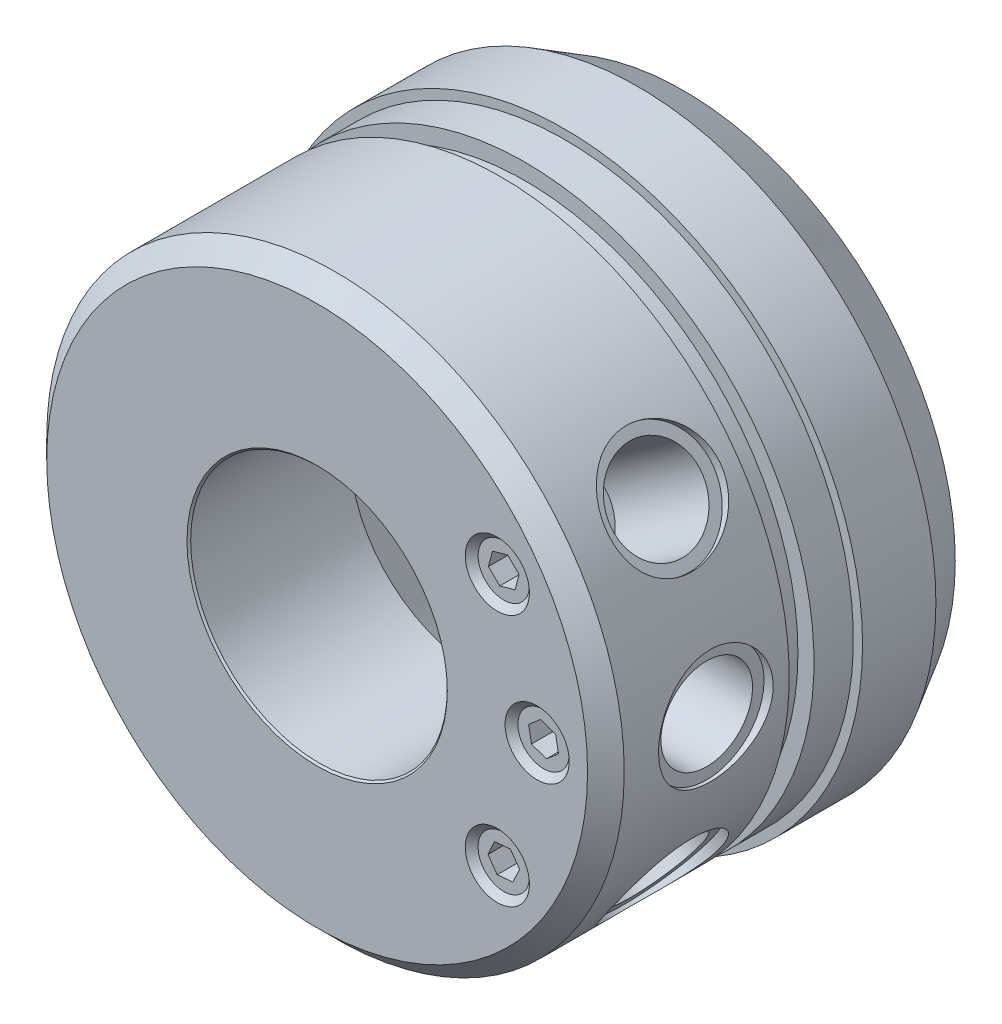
ISO-10303-21;
HEADER;
FILE_DESCRIPTION(('STEP AP214'),'2;1');
FILE_NAME('part.step','',(''),(''),'','','');
FILE_SCHEMA(('AUTOMOTIVE_DESIGN { 1 0 10303 214 1 1 1 1 }'));
ENDSEC;
DATA;
#1=APPLICATION_CONTEXT('core data for automotive mechanical design processes');
#2=APPLICATION_PROTOCOL_DEFINITION('international standard','automotive_design',2000,#1);
#3=PRODUCT_CONTEXT('',#1,'mechanical');
#4=PRODUCT('Part','Part','',(#3));
#5=PRODUCT_RELATED_PRODUCT_CATEGORY('part','',(#4));
#6=PRODUCT_DEFINITION_FORMATION('','',#4);
#7=PRODUCT_DEFINITION_CONTEXT('part definition',#1,'design');
#8=PRODUCT_DEFINITION('design','',#6,#7);
#9=PRODUCT_DEFINITION_SHAPE('','',#8);
#10=(LENGTH_UNIT() NAMED_UNIT(*) SI_UNIT(.MILLI.,.METRE.));
#11=(NAMED_UNIT(*) PLANE_ANGLE_UNIT() SI_UNIT($,.RADIAN.));
#12=(NAMED_UNIT(*) SI_UNIT($,.STERADIAN.) SOLID_ANGLE_UNIT());
#13=UNCERTAINTY_MEASURE_WITH_UNIT(LENGTH_MEASURE(1.E-05),#10,'distance_accuracy_value','');
#14=(GEOMETRIC_REPRESENTATION_CONTEXT(3) GLOBAL_UNCERTAINTY_ASSIGNED_CONTEXT((#13)) GLOBAL_UNIT_ASSIGNED_CONTEXT((#10,
#11,#12)) REPRESENTATION_CONTEXT('',''));
#15=CARTESIAN_POINT('',(0.,0.,0.));
#16=DIRECTION('',(0.,0.,1.));
#17=DIRECTION('',(1.,0.,0.));
#18=AXIS2_PLACEMENT_3D('',#15,#16,#17);
#19=CARTESIAN_POINT('',(20.3810708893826,-12.1911756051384,35.8));
#20=DIRECTION('',(0.,0.,1.));
#21=DIRECTION('',(0.909129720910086,-0.416513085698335,0.));
#22=AXIS2_PLACEMENT_3D('',#19,#20,#21);
#23=PLANE('',#22);
#24=DIRECTION('',(-0.579072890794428,0.815275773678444,0.));
#25=VECTOR('',#24,1.);
#26=CARTESIAN_POINT('',(21.3840545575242,-13.6032746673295,35.8000000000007));
#27=LINE('',#26,#25);
#28=CARTESIAN_POINT('',(21.3840545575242,-13.6032746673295,35.8000000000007));
#29=VERTEX_POINT('',#28);
#30=CARTESIAN_POINT('',(20.3810708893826,-12.1911756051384,35.8));
#31=VERTEX_POINT('',#30);
#32=EDGE_CURVE('E983',#29,#31,#27,.T.);
#33=ORIENTED_EDGE('',*,*,#32,.T.);
#34=DIRECTION('',(-0.995585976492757,-0.0938539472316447,0.));
#35=VECTOR('',#34,1.);
#36=CARTESIAN_POINT('',(20.3810708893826,-12.1911756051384,35.8));
#37=LINE('',#36,#35);
#38=CARTESIAN_POINT('',(18.656665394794,-12.3537354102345,35.8));
#39=VERTEX_POINT('',#38);
#40=EDGE_CURVE('E986',#31,#39,#37,.T.);
#41=ORIENTED_EDGE('',*,*,#40,.T.);
#42=DIRECTION('',(-0.416513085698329,-0.909129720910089,0.));
#43=VECTOR('',#42,1.);
#44=CARTESIAN_POINT('',(18.656665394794,-12.3537354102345,35.8));
#45=LINE('',#44,#43);
#46=CARTESIAN_POINT('',(17.9352435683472,-13.9283942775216,35.8));
#47=VERTEX_POINT('',#46);
#48=EDGE_CURVE('E989',#39,#47,#45,.T.);
#49=ORIENTED_EDGE('',*,*,#48,.T.);
#50=DIRECTION('',(0.579072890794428,-0.815275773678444,0.));
#51=VECTOR('',#50,1.);
#52=CARTESIAN_POINT('',(17.9352435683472,-13.9283942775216,35.8));
#53=LINE('',#52,#51);
#54=CARTESIAN_POINT('',(18.938227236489,-15.3404933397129,35.8000000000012));
#55=VERTEX_POINT('',#54);
#56=EDGE_CURVE('E992',#47,#55,#53,.T.);
#57=ORIENTED_EDGE('',*,*,#56,.T.);
#58=DIRECTION('',(0.995585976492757,0.0938539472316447,0.));
#59=VECTOR('',#58,1.);
#60=CARTESIAN_POINT('',(18.938227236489,-15.3404933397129,35.8000000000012));
#61=LINE('',#60,#59);
#62=CARTESIAN_POINT('',(20.6626327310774,-15.1779335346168,35.800000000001));
#63=VERTEX_POINT('',#62);
#64=EDGE_CURVE('E995',#55,#63,#61,.T.);
#65=ORIENTED_EDGE('',*,*,#64,.T.);
#66=DIRECTION('',(0.416513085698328,0.90912972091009,0.));
#67=VECTOR('',#66,1.);
#68=CARTESIAN_POINT('',(20.6626327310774,-15.1779335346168,35.800000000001));
#69=LINE('',#68,#67);
#70=EDGE_CURVE('E998',#63,#29,#69,.T.);
#71=ORIENTED_EDGE('',*,*,#70,.T.);
#72=EDGE_LOOP('',(#33,#41,#49,#57,#65,#71));
#73=FACE_BOUND('',#72,.T.);
#74=ADVANCED_FACE('F14',(#73),#23,.T.);
#75=CARTESIAN_POINT('',(18.656665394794,-12.3537354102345,35.8));
#76=DIRECTION('',(-0.909129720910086,0.416513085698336,0.));
#77=DIRECTION('',(-0.416513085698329,-0.909129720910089,0.));
#78=AXIS2_PLACEMENT_3D('',#75,#76,#77);
#79=PLANE('',#78);
#80=DIRECTION('',(-0.416513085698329,-0.909129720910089,0.));
#81=VECTOR('',#80,1.);
#82=CARTESIAN_POINT('',(18.6566653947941,-12.3537354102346,39.3));
#83=LINE('',#82,#81);
#84=CARTESIAN_POINT('',(18.6566653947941,-12.3537354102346,39.3));
#85=VERTEX_POINT('',#84);
#86=CARTESIAN_POINT('',(17.9352435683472,-13.9283942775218,39.3));
#87=VERTEX_POINT('',#86);
#88=EDGE_CURVE('E969',#85,#87,#83,.T.);
#89=ORIENTED_EDGE('',*,*,#88,.T.);
#90=DIRECTION('',(0.,0.,1.));
#91=VECTOR('',#90,1.);
#92=CARTESIAN_POINT('',(17.9352435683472,-13.9283942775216,35.8));
#93=LINE('',#92,#91);
#94=EDGE_CURVE('E1009',#47,#87,#93,.T.);
#95=ORIENTED_EDGE('',*,*,#94,.F.);
#96=ORIENTED_EDGE('',*,*,#48,.F.);
#97=DIRECTION('',(0.,0.,1.));
#98=VECTOR('',#97,1.);
#99=CARTESIAN_POINT('',(18.656665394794,-12.3537354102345,35.8));
#100=LINE('',#99,#98);
#101=EDGE_CURVE('E1012',#39,#85,#100,.T.);
#102=ORIENTED_EDGE('',*,*,#101,.T.);
#103=EDGE_LOOP('',(#89,#95,#96,#102));
#104=FACE_BOUND('',#103,.T.);
#105=ADVANCED_FACE('F496',(#104),#79,.F.);
#106=CARTESIAN_POINT('',(17.9352435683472,-13.9283942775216,35.8));
#107=DIRECTION('',(-0.815275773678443,-0.579072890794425,0.));
#108=DIRECTION('',(0.579072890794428,-0.815275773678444,0.));
#109=AXIS2_PLACEMENT_3D('',#106,#107,#108);
#110=PLANE('',#109);
#111=DIRECTION('',(0.579072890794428,-0.815275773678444,0.));
#112=VECTOR('',#111,1.);
#113=CARTESIAN_POINT('',(17.9352435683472,-13.9283942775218,39.3));
#114=LINE('',#113,#112);
#115=CARTESIAN_POINT('',(18.9382272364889,-15.3404933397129,39.3000000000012));
#116=VERTEX_POINT('',#115);
#117=EDGE_CURVE('E974',#87,#116,#114,.T.);
#118=ORIENTED_EDGE('',*,*,#117,.T.);
#119=DIRECTION('',(0.,0.,1.));
#120=VECTOR('',#119,1.);
#121=CARTESIAN_POINT('',(18.938227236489,-15.3404933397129,35.8000000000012));
#122=LINE('',#121,#120);
#123=EDGE_CURVE('E1006',#55,#116,#122,.T.);
#124=ORIENTED_EDGE('',*,*,#123,.F.);
#125=ORIENTED_EDGE('',*,*,#56,.F.);
#126=ORIENTED_EDGE('',*,*,#94,.T.);
#127=EDGE_LOOP('',(#118,#124,#125,#126));
#128=FACE_BOUND('',#127,.T.);
#129=ADVANCED_FACE('F506',(#128),#110,.F.);
#130=CARTESIAN_POINT('',(18.938227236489,-15.3404933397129,35.8000000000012));
#131=DIRECTION('',(0.0938539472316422,-0.995585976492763,0.));
#132=DIRECTION('',(0.995585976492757,0.0938539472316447,0.));
#133=AXIS2_PLACEMENT_3D('',#130,#131,#132);
#134=PLANE('',#133);
#135=DIRECTION('',(0.995585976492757,0.0938539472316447,0.));
#136=VECTOR('',#135,1.);
#137=CARTESIAN_POINT('',(18.9382272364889,-15.3404933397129,39.3000000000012));
#138=LINE('',#137,#136);
#139=CARTESIAN_POINT('',(20.6626327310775,-15.1779335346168,39.300000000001));
#140=VERTEX_POINT('',#139);
#141=EDGE_CURVE('E977',#116,#140,#138,.T.);
#142=ORIENTED_EDGE('',*,*,#141,.T.);
#143=DIRECTION('',(0.,0.,1.));
#144=VECTOR('',#143,1.);
#145=CARTESIAN_POINT('',(20.6626327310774,-15.1779335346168,35.800000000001));
#146=LINE('',#145,#144);
#147=EDGE_CURVE('E1003',#63,#140,#146,.T.);
#148=ORIENTED_EDGE('',*,*,#147,.F.);
#149=ORIENTED_EDGE('',*,*,#64,.F.);
#150=ORIENTED_EDGE('',*,*,#123,.T.);
#151=EDGE_LOOP('',(#142,#148,#149,#150));
#152=FACE_BOUND('',#151,.T.);
#153=ADVANCED_FACE('F502',(#152),#134,.F.);
#154=CARTESIAN_POINT('',(20.6626327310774,-15.1779335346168,35.800000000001));
#155=DIRECTION('',(0.909129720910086,-0.416513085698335,0.));
#156=DIRECTION('',(0.,0.,-1.));
#157=AXIS2_PLACEMENT_3D('',#154,#155,#156);
#158=PLANE('',#157);
#159=DIRECTION('',(0.416513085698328,0.90912972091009,0.));
#160=VECTOR('',#159,1.);
#161=CARTESIAN_POINT('',(20.6626327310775,-15.1779335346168,39.300000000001));
#162=LINE('',#161,#160);
#163=CARTESIAN_POINT('',(21.3840545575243,-13.6032746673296,39.3000000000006));
#164=VERTEX_POINT('',#163);
#165=EDGE_CURVE('E980',#140,#164,#162,.T.);
#166=ORIENTED_EDGE('',*,*,#165,.T.);
#167=DIRECTION('',(0.,0.,1.));
#168=VECTOR('',#167,1.);
#169=CARTESIAN_POINT('',(21.3840545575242,-13.6032746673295,35.8000000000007));
#170=LINE('',#169,#168);
#171=EDGE_CURVE('E24',#29,#164,#170,.T.);
#172=ORIENTED_EDGE('',*,*,#171,.F.);
#173=ORIENTED_EDGE('',*,*,#70,.F.);
#174=ORIENTED_EDGE('',*,*,#147,.T.);
#175=EDGE_LOOP('',(#166,#172,#173,#174));
#176=FACE_BOUND('',#175,.T.);
#177=ADVANCED_FACE('F498',(#176),#158,.F.);
#178=CARTESIAN_POINT('',(21.3840545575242,-13.6032746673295,35.8000000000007));
#179=DIRECTION('',(0.815275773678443,0.579072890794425,0.));
#180=DIRECTION('',(-0.579072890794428,0.815275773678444,0.));
#181=AXIS2_PLACEMENT_3D('',#178,#179,#180);
#182=PLANE('',#181);
#183=DIRECTION('',(-0.579072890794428,0.815275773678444,0.));
#184=VECTOR('',#183,1.);
#185=CARTESIAN_POINT('',(21.3840545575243,-13.6032746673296,39.3000000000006));
#186=LINE('',#185,#184);
#187=CARTESIAN_POINT('',(20.3810708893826,-12.1911756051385,39.3));
#188=VERTEX_POINT('',#187);
#189=EDGE_CURVE('E33',#164,#188,#186,.T.);
#190=ORIENTED_EDGE('',*,*,#189,.T.);
#191=DIRECTION('',(0.,0.,1.));
#192=VECTOR('',#191,1.);
#193=CARTESIAN_POINT('',(20.3810708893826,-12.1911756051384,35.8));
#194=LINE('',#193,#192);
#195=EDGE_CURVE('E1001',#31,#188,#194,.T.);
#196=ORIENTED_EDGE('',*,*,#195,.F.);
#197=ORIENTED_EDGE('',*,*,#32,.F.);
#198=ORIENTED_EDGE('',*,*,#171,.T.);
#199=EDGE_LOOP('',(#190,#196,#197,#198));
#200=FACE_BOUND('',#199,.T.);
#201=ADVANCED_FACE('F501',(#200),#182,.F.);
#202=CARTESIAN_POINT('',(20.3810708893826,-12.1911756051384,35.8));
#203=DIRECTION('',(-0.0938539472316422,0.995585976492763,0.));
#204=DIRECTION('',(-0.995585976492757,-0.0938539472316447,0.));
#205=AXIS2_PLACEMENT_3D('',#202,#203,#204);
#206=PLANE('',#205);
#207=DIRECTION('',(-0.995585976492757,-0.0938539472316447,0.));
#208=VECTOR('',#207,1.);
#209=CARTESIAN_POINT('',(20.3810708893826,-12.1911756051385,39.3));
#210=LINE('',#209,#208);
#211=EDGE_CURVE('E966',#188,#85,#210,.T.);
#212=ORIENTED_EDGE('',*,*,#211,.T.);
#213=ORIENTED_EDGE('',*,*,#101,.F.);
#214=ORIENTED_EDGE('',*,*,#40,.F.);
#215=ORIENTED_EDGE('',*,*,#195,.T.);
#216=EDGE_LOOP('',(#212,#213,#214,#215));
#217=FACE_BOUND('',#216,.T.);
#218=ADVANCED_FACE('F310',(#217),#206,.F.);
#219=CARTESIAN_POINT('',(20.9091883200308,-11.0384453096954,39.3));
#220=DIRECTION('',(0.,0.,-1.));
#221=DIRECTION('',(-0.909129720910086,0.416513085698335,0.));
#222=AXIS2_PLACEMENT_3D('',#219,#220,#221);
#223=PLANE('',#222);
#224=ORIENTED_EDGE('',*,*,#211,.F.);
#225=ORIENTED_EDGE('',*,*,#189,.F.);
#226=ORIENTED_EDGE('',*,*,#165,.F.);
#227=ORIENTED_EDGE('',*,*,#141,.F.);
#228=ORIENTED_EDGE('',*,*,#117,.F.);
#229=ORIENTED_EDGE('',*,*,#88,.F.);
#230=EDGE_LOOP('',(#224,#225,#226,#227,#228,#229));
#231=FACE_BOUND('',#230,.T.);
#232=CARTESIAN_POINT('',(19.6596490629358,-13.7658344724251,39.3));
#233=DIRECTION('',(0.,0.,-1.));
#234=DIRECTION('',(-1.,0.,0.));
#235=AXIS2_PLACEMENT_3D('',#232,#233,#234);
#236=CIRCLE('',#235,2.8);
#237=CARTESIAN_POINT('',(16.8596490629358,-13.7658344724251,39.3));
#238=VERTEX_POINT('',#237);
#239=EDGE_CURVE('E9',#238,#238,#236,.T.);
#240=ORIENTED_EDGE('',*,*,#239,.F.);
#241=EDGE_LOOP('',(#240));
#242=FACE_BOUND('',#241,.T.);
#243=ADVANCED_FACE('F300',(#231,#242),#223,.F.);
#244=CARTESIAN_POINT('',(0.,0.,0.));
#245=DIRECTION('',(0.,0.,1.));
#246=DIRECTION('',(1.,0.,0.));
#247=AXIS2_PLACEMENT_3D('',#244,#245,#246);
#248=CONICAL_SURFACE('',#247,29.6132486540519,0.523598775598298);
#249=CARTESIAN_POINT('',(0.,0.,5.));
#250=DIRECTION('',(0.,0.,-1.));
#251=DIRECTION('',(-1.,0.,0.));
#252=AXIS2_PLACEMENT_3D('',#249,#250,#251);
#253=CIRCLE('',#252,32.5);
#254=CARTESIAN_POINT('',(-32.5,0.,5.));
#255=VERTEX_POINT('',#254);
#256=EDGE_CURVE('E251',#255,#255,#253,.F.);
#257=ORIENTED_EDGE('',*,*,#256,.F.);
#258=EDGE_LOOP('',(#257));
#259=FACE_BOUND('',#258,.T.);
#260=CARTESIAN_POINT('',(0.,0.,0.));
#261=DIRECTION('',(0.,0.,-1.));
#262=DIRECTION('',(-1.,0.,0.));
#263=AXIS2_PLACEMENT_3D('',#260,#261,#262);
#264=CIRCLE('',#263,29.6132486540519);
#265=CARTESIAN_POINT('',(-29.6132486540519,0.,0.));
#266=VERTEX_POINT('',#265);
#267=EDGE_CURVE('E248',#266,#266,#264,.T.);
#268=ORIENTED_EDGE('',*,*,#267,.F.);
#269=EDGE_LOOP('',(#268));
#270=FACE_BOUND('',#269,.T.);
#271=ADVANCED_FACE('F297',(#259,#270),#248,.T.);
#272=CARTESIAN_POINT('',(0.,32.5,0.));
#273=DIRECTION('',(0.,0.,-1.));
#274=DIRECTION('',(-1.,0.,0.));
#275=AXIS2_PLACEMENT_3D('',#272,#273,#274);
#276=PLANE('',#275);
#277=CARTESIAN_POINT('',(0.,0.,0.));
#278=DIRECTION('',(0.,0.,-1.));
#279=DIRECTION('',(-1.,0.,0.));
#280=AXIS2_PLACEMENT_3D('',#277,#278,#279);
#281=CIRCLE('',#280,28.5);
#282=CARTESIAN_POINT('',(-28.5,0.,0.));
#283=VERTEX_POINT('',#282);
#284=EDGE_CURVE('E18',#283,#283,#281,.F.);
#285=ORIENTED_EDGE('',*,*,#284,.T.);
#286=EDGE_LOOP('',(#285));
#287=FACE_BOUND('',#286,.T.);
#288=ORIENTED_EDGE('',*,*,#267,.T.);
#289=EDGE_LOOP('',(#288));
#290=FACE_BOUND('',#289,.T.);
#291=ADVANCED_FACE('F299',(#287,#290),#276,.T.);
#292=CARTESIAN_POINT('',(0.,0.,0.));
#293=DIRECTION('',(0.,0.,-1.));
#294=DIRECTION('',(-1.,0.,0.));
#295=AXIS2_PLACEMENT_3D('',#292,#293,#294);
#296=CYLINDRICAL_SURFACE('',#295,32.5);
#297=ORIENTED_EDGE('',*,*,#256,.T.);
#298=EDGE_LOOP('',(#297));
#299=FACE_BOUND('',#298,.T.);
#300=CARTESIAN_POINT('',(0.,0.,13.));
#301=DIRECTION('',(0.,0.,-1.));
#302=DIRECTION('',(-1.,0.,0.));
#303=AXIS2_PLACEMENT_3D('',#300,#301,#302);
#304=CIRCLE('',#303,32.5);
#305=CARTESIAN_POINT('',(-32.5,0.,13.));
#306=VERTEX_POINT('',#305);
#307=EDGE_CURVE('E230',#306,#306,#304,.T.);
#308=ORIENTED_EDGE('',*,*,#307,.T.);
#309=EDGE_LOOP('',(#308));
#310=FACE_BOUND('',#309,.T.);
#311=ADVANCED_FACE('F307',(#299,#310),#296,.T.);
#312=CARTESIAN_POINT('',(0.,0.,1.));
#313=DIRECTION('',(0.,0.,-1.));
#314=DIRECTION('',(-1.,0.,0.));
#315=AXIS2_PLACEMENT_3D('',#312,#313,#314);
#316=CONICAL_SURFACE('',#315,27.5,0.78539816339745);
#317=ORIENTED_EDGE('',*,*,#284,.F.);
#318=EDGE_LOOP('',(#317));
#319=FACE_BOUND('',#318,.T.);
#320=CARTESIAN_POINT('',(0.,0.,1.));
#321=DIRECTION('',(0.,0.,-1.));
#322=DIRECTION('',(-1.,0.,0.));
#323=AXIS2_PLACEMENT_3D('',#320,#321,#322);
#324=CIRCLE('',#323,27.5);
#325=CARTESIAN_POINT('',(-27.5,0.,1.));
#326=VERTEX_POINT('',#325);
#327=EDGE_CURVE('E349',#326,#326,#324,.T.);
#328=ORIENTED_EDGE('',*,*,#327,.F.);
#329=EDGE_LOOP('',(#328));
#330=FACE_BOUND('',#329,.T.);
#331=ADVANCED_FACE('F16',(#319,#330),#316,.F.);
#332=CARTESIAN_POINT('',(0.,31.5,13.));
#333=DIRECTION('',(0.,0.,1.));
#334=DIRECTION('',(1.,0.,0.));
#335=AXIS2_PLACEMENT_3D('',#332,#333,#334);
#336=PLANE('',#335);
#337=CARTESIAN_POINT('',(0.,0.,13.));
#338=DIRECTION('',(0.,0.,-1.));
#339=DIRECTION('',(-1.,0.,0.));
#340=AXIS2_PLACEMENT_3D('',#337,#338,#339);
#341=CIRCLE('',#340,31.5);
#342=CARTESIAN_POINT('',(-31.5,0.,13.));
#343=VERTEX_POINT('',#342);
#344=EDGE_CURVE('E227',#343,#343,#341,.T.);
#345=ORIENTED_EDGE('',*,*,#344,.T.);
#346=EDGE_LOOP('',(#345));
#347=FACE_BOUND('',#346,.T.);
#348=ORIENTED_EDGE('',*,*,#307,.F.);
#349=EDGE_LOOP('',(#348));
#350=FACE_BOUND('',#349,.T.);
#351=ADVANCED_FACE('F359',(#347,#350),#336,.T.);
#352=CARTESIAN_POINT('',(0.,0.,0.));
#353=DIRECTION('',(0.,0.,-1.));
#354=DIRECTION('',(-1.,0.,0.));
#355=AXIS2_PLACEMENT_3D('',#352,#353,#354);
#356=CYLINDRICAL_SURFACE('',#355,27.5);
#357=ORIENTED_EDGE('',*,*,#327,.T.);
#358=EDGE_LOOP('',(#357));
#359=FACE_BOUND('',#358,.T.);
#360=CARTESIAN_POINT('',(0.,0.,8.5));
#361=DIRECTION('',(0.,0.,-1.));
#362=DIRECTION('',(-1.,0.,0.));
#363=AXIS2_PLACEMENT_3D('',#360,#361,#362);
#364=CIRCLE('',#363,27.5);
#365=CARTESIAN_POINT('',(-27.5,0.,8.5));
#366=VERTEX_POINT('',#365);
#367=EDGE_CURVE('E233',#366,#366,#364,.T.);
#368=ORIENTED_EDGE('',*,*,#367,.F.);
#369=EDGE_LOOP('',(#368));
#370=FACE_BOUND('',#369,.T.);
#371=ADVANCED_FACE('F364',(#359,#370),#356,.F.);
#372=CARTESIAN_POINT('',(0.,0.,0.));
#373=DIRECTION('',(0.,0.,-1.));
#374=DIRECTION('',(-1.,0.,0.));
#375=AXIS2_PLACEMENT_3D('',#372,#373,#374);
#376=CYLINDRICAL_SURFACE('',#375,31.5);
#377=CARTESIAN_POINT('',(0.,0.,17.3));
#378=DIRECTION('',(0.,0.,-1.));
#379=DIRECTION('',(-1.,0.,0.));
#380=AXIS2_PLACEMENT_3D('',#377,#378,#379);
#381=CIRCLE('',#380,31.5);
#382=CARTESIAN_POINT('',(-31.5,0.,17.3));
#383=VERTEX_POINT('',#382);
#384=EDGE_CURVE('E185',#383,#383,#381,.T.);
#385=ORIENTED_EDGE('',*,*,#384,.T.);
#386=EDGE_LOOP('',(#385));
#387=FACE_BOUND('',#386,.T.);
#388=ORIENTED_EDGE('',*,*,#344,.F.);
#389=EDGE_LOOP('',(#388));
#390=FACE_BOUND('',#389,.T.);
#391=ADVANCED_FACE('F374',(#387,#390),#376,.T.);
#392=CARTESIAN_POINT('',(0.,28.,8.5));
#393=DIRECTION('',(0.,0.,1.));
#394=DIRECTION('',(1.,0.,0.));
#395=AXIS2_PLACEMENT_3D('',#392,#393,#394);
#396=PLANE('',#395);
#397=ORIENTED_EDGE('',*,*,#367,.T.);
#398=EDGE_LOOP('',(#397));
#399=FACE_BOUND('',#398,.T.);
#400=CARTESIAN_POINT('',(0.,0.,8.5));
#401=DIRECTION('',(0.,0.,-1.));
#402=DIRECTION('',(-1.,0.,0.));
#403=AXIS2_PLACEMENT_3D('',#400,#401,#402);
#404=CIRCLE('',#403,28.);
#405=CARTESIAN_POINT('',(-28.,0.,8.5));
#406=VERTEX_POINT('',#405);
#407=EDGE_CURVE('E236',#406,#406,#404,.T.);
#408=ORIENTED_EDGE('',*,*,#407,.F.);
#409=EDGE_LOOP('',(#408));
#410=FACE_BOUND('',#409,.T.);
#411=ADVANCED_FACE('F375',(#399,#410),#396,.T.);
#412=CARTESIAN_POINT('',(30.5,0.,28.));
#413=DIRECTION('',(1.,0.,0.));
#414=DIRECTION('',(0.,1.,0.));
#415=AXIS2_PLACEMENT_3D('',#412,#413,#414);
#416=CYLINDRICAL_SURFACE('',#415,5.);
#417=CARTESIAN_POINT('',(30.5,0.,28.));
#418=DIRECTION('',(1.,0.,0.));
#419=DIRECTION('',(0.,1.,0.));
#420=AXIS2_PLACEMENT_3D('',#417,#418,#419);
#421=CIRCLE('',#420,5.);
#422=CARTESIAN_POINT('',(30.5,5.,28.));
#423=VERTEX_POINT('',#422);
#424=EDGE_CURVE('E221',#423,#423,#421,.T.);
#425=ORIENTED_EDGE('',*,*,#424,.T.);
#426=EDGE_LOOP('',(#425));
#427=FACE_BOUND('',#426,.T.);
#428=CARTESIAN_POINT('',(18.,0.,28.));
#429=DIRECTION('',(1.,0.,0.));
#430=DIRECTION('',(0.,1.,0.));
#431=AXIS2_PLACEMENT_3D('',#428,#429,#430);
#432=CIRCLE('',#431,5.);
#433=CARTESIAN_POINT('',(18.,5.,28.));
#434=VERTEX_POINT('',#433);
#435=EDGE_CURVE('E218',#434,#434,#432,.T.);
#436=ORIENTED_EDGE('',*,*,#435,.F.);
#437=EDGE_LOOP('',(#436));
#438=FACE_BOUND('',#437,.T.);
#439=ADVANCED_FACE('F378',(#427,#438),#416,.F.);
#440=CARTESIAN_POINT('',(24.9841373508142,17.4940813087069,28.));
#441=DIRECTION('',(0.819152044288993,0.573576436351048,0.));
#442=DIRECTION('',(-0.573576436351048,0.819152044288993,0.));
#443=AXIS2_PLACEMENT_3D('',#440,#441,#442);
#444=CYLINDRICAL_SURFACE('',#443,5.);
#445=CARTESIAN_POINT('',(24.9841373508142,17.4940813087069,28.));
#446=DIRECTION('',(0.819152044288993,0.573576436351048,0.));
#447=DIRECTION('',(-0.573576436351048,0.819152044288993,0.));
#448=AXIS2_PLACEMENT_3D('',#445,#446,#447);
#449=CIRCLE('',#448,5.);
#450=CARTESIAN_POINT('',(22.116255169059,21.5898415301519,28.));
#451=VERTEX_POINT('',#450);
#452=EDGE_CURVE('E197',#451,#451,#449,.T.);
#453=ORIENTED_EDGE('',*,*,#452,.T.);
#454=EDGE_LOOP('',(#453));
#455=FACE_BOUND('',#454,.T.);
#456=CARTESIAN_POINT('',(14.7447367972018,10.3243758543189,28.));
#457=DIRECTION('',(0.819152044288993,0.573576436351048,0.));
#458=DIRECTION('',(-0.573576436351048,0.819152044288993,0.));
#459=AXIS2_PLACEMENT_3D('',#456,#457,#458);
#460=CIRCLE('',#459,5.);
#461=CARTESIAN_POINT('',(11.8768546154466,14.4201360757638,28.));
#462=VERTEX_POINT('',#461);
#463=EDGE_CURVE('E194',#462,#462,#460,.T.);
#464=ORIENTED_EDGE('',*,*,#463,.F.);
#465=EDGE_LOOP('',(#464));
#466=FACE_BOUND('',#465,.T.);
#467=ADVANCED_FACE('F439',(#455,#466),#444,.F.);
#468=CARTESIAN_POINT('',(0.,29.75,17.3));
#469=DIRECTION('',(0.,0.,-1.));
#470=DIRECTION('',(-1.,0.,0.));
#471=AXIS2_PLACEMENT_3D('',#468,#469,#470);
#472=PLANE('',#471);
#473=ORIENTED_EDGE('',*,*,#384,.F.);
#474=EDGE_LOOP('',(#473));
#475=FACE_BOUND('',#474,.T.);
#476=CARTESIAN_POINT('',(0.,0.,17.3));
#477=DIRECTION('',(0.,0.,-1.));
#478=DIRECTION('',(-1.,0.,0.));
#479=AXIS2_PLACEMENT_3D('',#476,#477,#478);
#480=CIRCLE('',#479,29.75);
#481=CARTESIAN_POINT('',(-29.75,0.,17.3));
#482=VERTEX_POINT('',#481);
#483=EDGE_CURVE('E188',#482,#482,#480,.T.);
#484=ORIENTED_EDGE('',*,*,#483,.T.);
#485=EDGE_LOOP('',(#484));
#486=FACE_BOUND('',#485,.T.);
#487=ADVANCED_FACE('F384',(#475,#486),#472,.F.);
#488=CARTESIAN_POINT('',(0.,0.,0.));
#489=DIRECTION('',(0.,0.,-1.));
#490=DIRECTION('',(-1.,0.,0.));
#491=AXIS2_PLACEMENT_3D('',#488,#489,#490);
#492=CYLINDRICAL_SURFACE('',#491,28.);
#493=ORIENTED_EDGE('',*,*,#407,.T.);
#494=EDGE_LOOP('',(#493));
#495=FACE_BOUND('',#494,.T.);
#496=CARTESIAN_POINT('',(0.,0.,11.5));
#497=DIRECTION('',(0.,0.,-1.));
#498=DIRECTION('',(-1.,0.,0.));
#499=AXIS2_PLACEMENT_3D('',#496,#497,#498);
#500=CIRCLE('',#499,28.);
#501=CARTESIAN_POINT('',(-28.,0.,11.5));
#502=VERTEX_POINT('',#501);
#503=EDGE_CURVE('E239',#502,#502,#500,.T.);
#504=ORIENTED_EDGE('',*,*,#503,.F.);
#505=EDGE_LOOP('',(#504));
#506=FACE_BOUND('',#505,.T.);
#507=ADVANCED_FACE('F380',(#495,#506),#492,.F.);
#508=CARTESIAN_POINT('',(23.6877669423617,1.70367559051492,35.8));
#509=DIRECTION('',(0.,0.,1.));
#510=DIRECTION('',(0.983617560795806,0.180267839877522,0.));
#511=AXIS2_PLACEMENT_3D('',#508,#509,#510);
#512=PLANE('',#511);
#513=DIRECTION('',(-0.941971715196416,0.335692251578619,0.));
#514=VECTOR('',#513,1.);
#515=CARTESIAN_POINT('',(25.3193098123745,1.12223955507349,35.8000000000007));
#516=LINE('',#515,#514);
#517=CARTESIAN_POINT('',(25.3193098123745,1.12223955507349,35.8000000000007));
#518=VERTEX_POINT('',#517);
#519=CARTESIAN_POINT('',(23.6877669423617,1.70367559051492,35.8));
#520=VERTEX_POINT('',#519);
#521=EDGE_CURVE('E941',#518,#520,#516,.T.);
#522=ORIENTED_EDGE('',*,*,#521,.T.);
#523=DIRECTION('',(-0.761703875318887,-0.647925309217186,0.));
#524=VECTOR('',#523,1.);
#525=CARTESIAN_POINT('',(23.6877669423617,1.70367559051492,35.8));
#526=LINE('',#525,#524);
#527=CARTESIAN_POINT('',(22.3684571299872,0.581436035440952,35.8));
#528=VERTEX_POINT('',#527);
#529=EDGE_CURVE('E921',#520,#528,#526,.T.);
#530=ORIENTED_EDGE('',*,*,#529,.T.);
#531=DIRECTION('',(0.18026783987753,-0.983617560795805,0.));
#532=VECTOR('',#531,1.);
#533=CARTESIAN_POINT('',(22.3684571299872,0.581436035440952,35.8));
#534=LINE('',#533,#532);
#535=CARTESIAN_POINT('',(22.6806901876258,-1.12223955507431,35.8));
#536=VERTEX_POINT('',#535);
#537=EDGE_CURVE('E944',#528,#536,#534,.T.);
#538=ORIENTED_EDGE('',*,*,#537,.T.);
#539=DIRECTION('',(0.941971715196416,-0.335692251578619,0.));
#540=VECTOR('',#539,1.);
#541=CARTESIAN_POINT('',(22.6806901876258,-1.12223955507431,35.8));
#542=LINE('',#541,#540);
#543=CARTESIAN_POINT('',(24.3122330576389,-1.70367559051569,35.8000000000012));
#544=VERTEX_POINT('',#543);
#545=EDGE_CURVE('E947',#536,#544,#542,.T.);
#546=ORIENTED_EDGE('',*,*,#545,.T.);
#547=DIRECTION('',(0.761703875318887,0.647925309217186,0.));
#548=VECTOR('',#547,1.);
#549=CARTESIAN_POINT('',(24.3122330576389,-1.70367559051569,35.8000000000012));
#550=LINE('',#549,#548);
#551=CARTESIAN_POINT('',(25.6315428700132,-0.581436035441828,35.800000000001));
#552=VERTEX_POINT('',#551);
#553=EDGE_CURVE('E950',#544,#552,#550,.T.);
#554=ORIENTED_EDGE('',*,*,#553,.T.);
#555=DIRECTION('',(-0.180267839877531,0.983617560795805,0.));
#556=VECTOR('',#555,1.);
#557=CARTESIAN_POINT('',(25.6315428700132,-0.581436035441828,35.800000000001));
#558=LINE('',#557,#556);
#559=EDGE_CURVE('E924',#552,#518,#558,.T.);
#560=ORIENTED_EDGE('',*,*,#559,.T.);
#561=EDGE_LOOP('',(#522,#530,#538,#546,#554,#560));
#562=FACE_BOUND('',#561,.T.);
#563=ADVANCED_FACE('F383',(#562),#512,.T.);
#564=CARTESIAN_POINT('',(18.426694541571,14.9823142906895,35.8));
#565=DIRECTION('',(0.,0.,1.));
#566=DIRECTION('',(0.702334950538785,0.711846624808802,0.));
#567=AXIS2_PLACEMENT_3D('',#564,#565,#566);
#568=PLANE('',#567);
#569=DIRECTION('',(-0.964163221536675,-0.265309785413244,0.));
#570=VECTOR('',#569,1.);
#571=CARTESIAN_POINT('',(20.0966742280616,15.4418443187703,35.8000000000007));
#572=LINE('',#571,#570);
#573=CARTESIAN_POINT('',(20.0966742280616,15.4418443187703,35.8000000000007));
#574=VERTEX_POINT('',#573);
#575=CARTESIAN_POINT('',(18.426694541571,14.9823142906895,35.8));
#576=VERTEX_POINT('',#575);
#577=EDGE_CURVE('E153',#574,#576,#572,.T.);
#578=ORIENTED_EDGE('',*,*,#577,.T.);
#579=DIRECTION('',(-0.252316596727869,-0.967644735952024,0.));
#580=VECTOR('',#579,1.);
#581=CARTESIAN_POINT('',(18.426694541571,14.9823142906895,35.8));
#582=LINE('',#581,#580);
#583=CARTESIAN_POINT('',(17.9896693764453,13.306304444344,35.8));
#584=VERTEX_POINT('',#583);
#585=EDGE_CURVE('E131',#576,#584,#582,.T.);
#586=ORIENTED_EDGE('',*,*,#585,.T.);
#587=DIRECTION('',(0.711846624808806,-0.70233495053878,0.));
#588=VECTOR('',#587,1.);
#589=CARTESIAN_POINT('',(17.9896693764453,13.306304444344,35.8));
#590=LINE('',#589,#588);
#591=CARTESIAN_POINT('',(19.2226238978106,12.0898246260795,35.8));
#592=VERTEX_POINT('',#591);
#593=EDGE_CURVE('E156',#584,#592,#590,.T.);
#594=ORIENTED_EDGE('',*,*,#593,.T.);
#595=DIRECTION('',(0.964163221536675,0.265309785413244,0.));
#596=VECTOR('',#595,1.);
#597=CARTESIAN_POINT('',(19.2226238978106,12.0898246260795,35.8));
#598=LINE('',#597,#596);
#599=CARTESIAN_POINT('',(20.8926035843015,12.5493546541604,35.8000000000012));
#600=VERTEX_POINT('',#599);
#601=EDGE_CURVE('E159',#592,#600,#598,.T.);
#602=ORIENTED_EDGE('',*,*,#601,.T.);
#603=DIRECTION('',(0.252316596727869,0.967644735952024,0.));
#604=VECTOR('',#603,1.);
#605=CARTESIAN_POINT('',(20.8926035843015,12.5493546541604,35.8000000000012));
#606=LINE('',#605,#604);
#607=CARTESIAN_POINT('',(21.329628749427,14.2253645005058,35.800000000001));
#608=VERTEX_POINT('',#607);
#609=EDGE_CURVE('E162',#600,#608,#606,.T.);
#610=ORIENTED_EDGE('',*,*,#609,.T.);
#611=DIRECTION('',(-0.711846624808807,0.702334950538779,0.));
#612=VECTOR('',#611,1.);
#613=CARTESIAN_POINT('',(21.329628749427,14.2253645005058,35.800000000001));
#614=LINE('',#613,#612);
#615=EDGE_CURVE('E134',#608,#574,#614,.T.);
#616=ORIENTED_EDGE('',*,*,#615,.T.);
#617=EDGE_LOOP('',(#578,#586,#594,#602,#610,#616));
#618=FACE_BOUND('',#617,.T.);
#619=ADVANCED_FACE('F521',(#618),#568,.T.);
#620=CARTESIAN_POINT('',(30.5,0.,28.));
#621=DIRECTION('',(1.,0.,0.));
#622=DIRECTION('',(0.,1.,0.));
#623=AXIS2_PLACEMENT_3D('',#620,#621,#622);
#624=PLANE('',#623);
#625=ORIENTED_EDGE('',*,*,#424,.F.);
#626=EDGE_LOOP('',(#625));
#627=FACE_BOUND('',#626,.T.);
#628=CARTESIAN_POINT('',(30.5,0.,28.));
#629=DIRECTION('',(1.,0.,0.));
#630=DIRECTION('',(0.,1.,0.));
#631=AXIS2_PLACEMENT_3D('',#628,#629,#630);
#632=CIRCLE('',#631,6.25);
#633=CARTESIAN_POINT('',(30.5,6.25,28.));
#634=VERTEX_POINT('',#633);
#635=EDGE_CURVE('E224',#634,#634,#632,.T.);
#636=ORIENTED_EDGE('',*,*,#635,.T.);
#637=EDGE_LOOP('',(#636));
#638=FACE_BOUND('',#637,.T.);
#639=ADVANCED_FACE('F278',(#627,#638),#624,.T.);
#640=CARTESIAN_POINT('',(24.9841373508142,17.4940813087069,28.));
#641=DIRECTION('',(0.819152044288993,0.573576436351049,0.));
#642=DIRECTION('',(-0.573576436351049,0.819152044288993,0.));
#643=AXIS2_PLACEMENT_3D('',#640,#641,#642);
#644=PLANE('',#643);
#645=ORIENTED_EDGE('',*,*,#452,.F.);
#646=EDGE_LOOP('',(#645));
#647=FACE_BOUND('',#646,.T.);
#648=CARTESIAN_POINT('',(24.9841373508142,17.4940813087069,28.));
#649=DIRECTION('',(0.819152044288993,0.573576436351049,0.));
#650=DIRECTION('',(-0.573576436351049,0.819152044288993,0.));
#651=AXIS2_PLACEMENT_3D('',#648,#649,#650);
#652=CIRCLE('',#651,6.25);
#653=CARTESIAN_POINT('',(21.3992846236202,22.6137815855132,28.));
#654=VERTEX_POINT('',#653);
#655=EDGE_CURVE('E200',#654,#654,#652,.T.);
#656=ORIENTED_EDGE('',*,*,#655,.T.);
#657=EDGE_LOOP('',(#656));
#658=FACE_BOUND('',#657,.T.);
#659=ADVANCED_FACE('F445',(#647,#658),#644,.T.);
#660=CARTESIAN_POINT('',(0.,0.,0.));
#661=DIRECTION('',(0.,0.,-1.));
#662=DIRECTION('',(-1.,0.,0.));
#663=AXIS2_PLACEMENT_3D('',#660,#661,#662);
#664=CYLINDRICAL_SURFACE('',#663,29.75);
#665=ORIENTED_EDGE('',*,*,#483,.F.);
#666=EDGE_LOOP('',(#665));
#667=FACE_BOUND('',#666,.T.);
#668=CARTESIAN_POINT('',(0.,0.,20.));
#669=DIRECTION('',(0.,0.,-1.));
#670=DIRECTION('',(-1.,0.,0.));
#671=AXIS2_PLACEMENT_3D('',#668,#669,#670);
#672=CIRCLE('',#671,29.75);
#673=CARTESIAN_POINT('',(-29.75,0.,20.));
#674=VERTEX_POINT('',#673);
#675=EDGE_CURVE('E179',#674,#674,#672,.T.);
#676=ORIENTED_EDGE('',*,*,#675,.T.);
#677=EDGE_LOOP('',(#676));
#678=FACE_BOUND('',#677,.T.);
#679=ADVANCED_FACE('F389',(#667,#678),#664,.T.);
#680=CARTESIAN_POINT('',(0.,20.3335324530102,11.5));
#681=DIRECTION('',(0.,0.,-1.));
#682=DIRECTION('',(-1.,0.,0.));
#683=AXIS2_PLACEMENT_3D('',#680,#681,#682);
#684=PLANE('',#683);
#685=ORIENTED_EDGE('',*,*,#503,.T.);
#686=EDGE_LOOP('',(#685));
#687=FACE_BOUND('',#686,.T.);
#688=CARTESIAN_POINT('',(0.,0.,11.5));
#689=DIRECTION('',(0.,0.,-1.));
#690=DIRECTION('',(-1.,0.,0.));
#691=AXIS2_PLACEMENT_3D('',#688,#689,#690);
#692=CIRCLE('',#691,20.3335324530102);
#693=CARTESIAN_POINT('',(-20.3335324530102,0.,11.5));
#694=VERTEX_POINT('',#693);
#695=EDGE_CURVE('E242',#694,#694,#692,.T.);
#696=ORIENTED_EDGE('',*,*,#695,.F.);
#697=EDGE_LOOP('',(#696));
#698=FACE_BOUND('',#697,.T.);
#699=ADVANCED_FACE('F386',(#687,#698),#684,.T.);
#700=CARTESIAN_POINT('',(22.3684571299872,0.581436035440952,35.8));
#701=DIRECTION('',(-0.983617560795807,-0.180267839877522,0.));
#702=DIRECTION('',(0.18026783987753,-0.983617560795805,0.));
#703=AXIS2_PLACEMENT_3D('',#700,#701,#702);
#704=PLANE('',#703);
#705=DIRECTION('',(0.18026783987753,-0.983617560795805,0.));
#706=VECTOR('',#705,1.);
#707=CARTESIAN_POINT('',(22.3684571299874,0.58143603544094,39.3));
#708=LINE('',#707,#706);
#709=CARTESIAN_POINT('',(22.3684571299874,0.58143603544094,39.3));
#710=VERTEX_POINT('',#709);
#711=CARTESIAN_POINT('',(22.680690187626,-1.12223955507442,39.3));
#712=VERTEX_POINT('',#711);
#713=EDGE_CURVE('E929',#710,#712,#708,.T.);
#714=ORIENTED_EDGE('',*,*,#713,.T.);
#715=DIRECTION('',(0.,0.,1.));
#716=VECTOR('',#715,1.);
#717=CARTESIAN_POINT('',(22.6806901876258,-1.12223955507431,35.8));
#718=LINE('',#717,#716);
#719=EDGE_CURVE('E961',#536,#712,#718,.T.);
#720=ORIENTED_EDGE('',*,*,#719,.F.);
#721=ORIENTED_EDGE('',*,*,#537,.F.);
#722=DIRECTION('',(0.,0.,1.));
#723=VECTOR('',#722,1.);
#724=CARTESIAN_POINT('',(22.3684571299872,0.581436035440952,35.8));
#725=LINE('',#724,#723);
#726=EDGE_CURVE('E923',#528,#710,#725,.T.);
#727=ORIENTED_EDGE('',*,*,#726,.T.);
#728=EDGE_LOOP('',(#714,#720,#721,#727));
#729=FACE_BOUND('',#728,.T.);
#730=ADVANCED_FACE('F388',(#729),#704,.F.);
#731=CARTESIAN_POINT('',(22.6806901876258,-1.12223955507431,35.8));
#732=DIRECTION('',(-0.33569225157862,-0.941971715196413,0.));
#733=DIRECTION('',(0.941971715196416,-0.335692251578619,0.));
#734=AXIS2_PLACEMENT_3D('',#731,#732,#733);
#735=PLANE('',#734);
#736=DIRECTION('',(0.941971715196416,-0.335692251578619,0.));
#737=VECTOR('',#736,1.);
#738=CARTESIAN_POINT('',(22.680690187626,-1.12223955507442,39.3));
#739=LINE('',#738,#737);
#740=CARTESIAN_POINT('',(24.3122330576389,-1.70367559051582,39.3000000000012));
#741=VERTEX_POINT('',#740);
#742=EDGE_CURVE('E931',#712,#741,#739,.T.);
#743=ORIENTED_EDGE('',*,*,#742,.T.);
#744=DIRECTION('',(0.,0.,1.));
#745=VECTOR('',#744,1.);
#746=CARTESIAN_POINT('',(24.3122330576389,-1.70367559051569,35.8000000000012));
#747=LINE('',#746,#745);
#748=EDGE_CURVE('E959',#544,#741,#747,.T.);
#749=ORIENTED_EDGE('',*,*,#748,.F.);
#750=ORIENTED_EDGE('',*,*,#545,.F.);
#751=ORIENTED_EDGE('',*,*,#719,.T.);
#752=EDGE_LOOP('',(#743,#749,#750,#751));
#753=FACE_BOUND('',#752,.T.);
#754=ADVANCED_FACE('F531',(#753),#735,.F.);
#755=CARTESIAN_POINT('',(24.3122330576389,-1.70367559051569,35.8000000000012));
#756=DIRECTION('',(0.647925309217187,-0.761703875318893,0.));
#757=DIRECTION('',(0.761703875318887,0.647925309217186,0.));
#758=AXIS2_PLACEMENT_3D('',#755,#756,#757);
#759=PLANE('',#758);
#760=DIRECTION('',(0.761703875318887,0.647925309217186,0.));
#761=VECTOR('',#760,1.);
#762=CARTESIAN_POINT('',(24.3122330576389,-1.70367559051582,39.3000000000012));
#763=LINE('',#762,#761);
#764=CARTESIAN_POINT('',(25.6315428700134,-0.581436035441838,39.300000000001));
#765=VERTEX_POINT('',#764);
#766=EDGE_CURVE('E936',#741,#765,#763,.T.);
#767=ORIENTED_EDGE('',*,*,#766,.T.);
#768=DIRECTION('',(0.,0.,1.));
#769=VECTOR('',#768,1.);
#770=CARTESIAN_POINT('',(25.6315428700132,-0.581436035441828,35.800000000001));
#771=LINE('',#770,#769);
#772=EDGE_CURVE('E957',#552,#765,#771,.T.);
#773=ORIENTED_EDGE('',*,*,#772,.F.);
#774=ORIENTED_EDGE('',*,*,#553,.F.);
#775=ORIENTED_EDGE('',*,*,#748,.T.);
#776=EDGE_LOOP('',(#767,#773,#774,#775));
#777=FACE_BOUND('',#776,.T.);
#778=ADVANCED_FACE('F527',(#777),#759,.F.);
#779=CARTESIAN_POINT('',(25.6315428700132,-0.581436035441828,35.800000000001));
#780=DIRECTION('',(0.983617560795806,0.180267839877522,0.));
#781=DIRECTION('',(0.,0.,-1.));
#782=AXIS2_PLACEMENT_3D('',#779,#780,#781);
#783=PLANE('',#782);
#784=DIRECTION('',(-0.180267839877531,0.983617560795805,0.));
#785=VECTOR('',#784,1.);
#786=CARTESIAN_POINT('',(25.6315428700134,-0.581436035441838,39.300000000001));
#787=LINE('',#786,#785);
#788=CARTESIAN_POINT('',(25.3193098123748,1.12223955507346,39.3000000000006));
#789=VERTEX_POINT('',#788);
#790=EDGE_CURVE('E939',#765,#789,#787,.T.);
#791=ORIENTED_EDGE('',*,*,#790,.T.);
#792=DIRECTION('',(0.,0.,1.));
#793=VECTOR('',#792,1.);
#794=CARTESIAN_POINT('',(25.3193098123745,1.12223955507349,35.8000000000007));
#795=LINE('',#794,#793);
#796=EDGE_CURVE('E912',#518,#789,#795,.T.);
#797=ORIENTED_EDGE('',*,*,#796,.F.);
#798=ORIENTED_EDGE('',*,*,#559,.F.);
#799=ORIENTED_EDGE('',*,*,#772,.T.);
#800=EDGE_LOOP('',(#791,#797,#798,#799));
#801=FACE_BOUND('',#800,.T.);
#802=ADVANCED_FACE('F523',(#801),#783,.F.);
#803=CARTESIAN_POINT('',(25.3193098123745,1.12223955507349,35.8000000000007));
#804=DIRECTION('',(0.33569225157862,0.941971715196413,0.));
#805=DIRECTION('',(-0.941971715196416,0.335692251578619,0.));
#806=AXIS2_PLACEMENT_3D('',#803,#804,#805);
#807=PLANE('',#806);
#808=DIRECTION('',(-0.941971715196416,0.335692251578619,0.));
#809=VECTOR('',#808,1.);
#810=CARTESIAN_POINT('',(25.3193098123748,1.12223955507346,39.3000000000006));
#811=LINE('',#810,#809);
#812=CARTESIAN_POINT('',(23.6877669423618,1.70367559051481,39.3));
#813=VERTEX_POINT('',#812);
#814=EDGE_CURVE('E178',#789,#813,#811,.T.);
#815=ORIENTED_EDGE('',*,*,#814,.T.);
#816=DIRECTION('',(0.,0.,1.));
#817=VECTOR('',#816,1.);
#818=CARTESIAN_POINT('',(23.6877669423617,1.70367559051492,35.8));
#819=LINE('',#818,#817);
#820=EDGE_CURVE('E910',#520,#813,#819,.T.);
#821=ORIENTED_EDGE('',*,*,#820,.F.);
#822=ORIENTED_EDGE('',*,*,#521,.F.);
#823=ORIENTED_EDGE('',*,*,#796,.T.);
#824=EDGE_LOOP('',(#815,#821,#822,#823));
#825=FACE_BOUND('',#824,.T.);
#826=ADVANCED_FACE('F526',(#825),#807,.F.);
#827=CARTESIAN_POINT('',(23.6877669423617,1.70367559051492,35.8));
#828=DIRECTION('',(-0.647925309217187,0.761703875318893,0.));
#829=DIRECTION('',(-0.761703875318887,-0.647925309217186,0.));
#830=AXIS2_PLACEMENT_3D('',#827,#828,#829);
#831=PLANE('',#830);
#832=DIRECTION('',(-0.761703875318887,-0.647925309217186,0.));
#833=VECTOR('',#832,1.);
#834=CARTESIAN_POINT('',(23.6877669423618,1.70367559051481,39.3));
#835=LINE('',#834,#833);
#836=EDGE_CURVE('E916',#813,#710,#835,.T.);
#837=ORIENTED_EDGE('',*,*,#836,.T.);
#838=ORIENTED_EDGE('',*,*,#726,.F.);
#839=ORIENTED_EDGE('',*,*,#529,.F.);
#840=ORIENTED_EDGE('',*,*,#820,.T.);
#841=EDGE_LOOP('',(#837,#838,#839,#840));
#842=FACE_BOUND('',#841,.T.);
#843=ADVANCED_FACE('F539',(#842),#831,.F.);
#844=CARTESIAN_POINT('',(17.9896693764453,13.306304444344,35.8));
#845=DIRECTION('',(-0.702334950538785,-0.711846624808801,0.));
#846=DIRECTION('',(0.711846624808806,-0.70233495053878,0.));
#847=AXIS2_PLACEMENT_3D('',#844,#845,#846);
#848=PLANE('',#847);
#849=DIRECTION('',(0.711846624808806,-0.70233495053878,0.));
#850=VECTOR('',#849,1.);
#851=CARTESIAN_POINT('',(17.9896693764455,13.306304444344,39.3));
#852=LINE('',#851,#850);
#853=CARTESIAN_POINT('',(17.9896693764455,13.306304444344,39.3));
#854=VERTEX_POINT('',#853);
#855=CARTESIAN_POINT('',(19.2226238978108,12.0898246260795,39.3));
#856=VERTEX_POINT('',#855);
#857=EDGE_CURVE('E140',#854,#856,#852,.T.);
#858=ORIENTED_EDGE('',*,*,#857,.T.);
#859=DIRECTION('',(0.,0.,1.));
#860=VECTOR('',#859,1.);
#861=CARTESIAN_POINT('',(19.2226238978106,12.0898246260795,35.8));
#862=LINE('',#861,#860);
#863=EDGE_CURVE('E173',#592,#856,#862,.T.);
#864=ORIENTED_EDGE('',*,*,#863,.F.);
#865=ORIENTED_EDGE('',*,*,#593,.F.);
#866=DIRECTION('',(0.,0.,1.));
#867=VECTOR('',#866,1.);
#868=CARTESIAN_POINT('',(17.9896693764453,13.306304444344,35.8));
#869=LINE('',#868,#867);
#870=EDGE_CURVE('E133',#584,#854,#869,.T.);
#871=ORIENTED_EDGE('',*,*,#870,.T.);
#872=EDGE_LOOP('',(#858,#864,#865,#871));
#873=FACE_BOUND('',#872,.T.);
#874=ADVANCED_FACE('F542',(#873),#848,.F.);
#875=CARTESIAN_POINT('',(19.2226238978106,12.0898246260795,35.8));
#876=DIRECTION('',(0.265309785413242,-0.964163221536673,0.));
#877=DIRECTION('',(0.964163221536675,0.265309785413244,0.));
#878=AXIS2_PLACEMENT_3D('',#875,#876,#877);
#879=PLANE('',#878);
#880=DIRECTION('',(0.964163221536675,0.265309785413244,0.));
#881=VECTOR('',#880,1.);
#882=CARTESIAN_POINT('',(19.2226238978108,12.0898246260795,39.3));
#883=LINE('',#882,#881);
#884=CARTESIAN_POINT('',(20.8926035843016,12.5493546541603,39.3000000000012));
#885=VERTEX_POINT('',#884);
#886=EDGE_CURVE('E142',#856,#885,#883,.T.);
#887=ORIENTED_EDGE('',*,*,#886,.T.);
#888=DIRECTION('',(0.,0.,1.));
#889=VECTOR('',#888,1.);
#890=CARTESIAN_POINT('',(20.8926035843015,12.5493546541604,35.8000000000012));
#891=LINE('',#890,#889);
#892=EDGE_CURVE('E171',#600,#885,#891,.T.);
#893=ORIENTED_EDGE('',*,*,#892,.F.);
#894=ORIENTED_EDGE('',*,*,#601,.F.);
#895=ORIENTED_EDGE('',*,*,#863,.T.);
#896=EDGE_LOOP('',(#887,#893,#894,#895));
#897=FACE_BOUND('',#896,.T.);
#898=ADVANCED_FACE('F556',(#897),#879,.F.);
#899=CARTESIAN_POINT('',(20.8926035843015,12.5493546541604,35.8000000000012));
#900=DIRECTION('',(0.967644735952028,-0.252316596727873,0.));
#901=DIRECTION('',(0.252316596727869,0.967644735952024,0.));
#902=AXIS2_PLACEMENT_3D('',#899,#900,#901);
#903=PLANE('',#902);
#904=DIRECTION('',(0.252316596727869,0.967644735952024,0.));
#905=VECTOR('',#904,1.);
#906=CARTESIAN_POINT('',(20.8926035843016,12.5493546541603,39.3000000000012));
#907=LINE('',#906,#905);
#908=CARTESIAN_POINT('',(21.3296287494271,14.2253645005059,39.300000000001));
#909=VERTEX_POINT('',#908);
#910=EDGE_CURVE('E148',#885,#909,#907,.T.);
#911=ORIENTED_EDGE('',*,*,#910,.T.);
#912=DIRECTION('',(0.,0.,1.));
#913=VECTOR('',#912,1.);
#914=CARTESIAN_POINT('',(21.329628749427,14.2253645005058,35.800000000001));
#915=LINE('',#914,#913);
#916=EDGE_CURVE('E169',#608,#909,#915,.T.);
#917=ORIENTED_EDGE('',*,*,#916,.F.);
#918=ORIENTED_EDGE('',*,*,#609,.F.);
#919=ORIENTED_EDGE('',*,*,#892,.T.);
#920=EDGE_LOOP('',(#911,#917,#918,#919));
#921=FACE_BOUND('',#920,.T.);
#922=ADVANCED_FACE('F553',(#921),#903,.F.);
#923=CARTESIAN_POINT('',(21.329628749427,14.2253645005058,35.800000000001));
#924=DIRECTION('',(0.702334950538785,0.711846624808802,0.));
#925=DIRECTION('',(0.,0.,-1.));
#926=AXIS2_PLACEMENT_3D('',#923,#924,#925);
#927=PLANE('',#926);
#928=DIRECTION('',(-0.711846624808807,0.702334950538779,0.));
#929=VECTOR('',#928,1.);
#930=CARTESIAN_POINT('',(21.3296287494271,14.2253645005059,39.300000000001));
#931=LINE('',#930,#929);
#932=CARTESIAN_POINT('',(20.0966742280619,15.4418443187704,39.3000000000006));
#933=VERTEX_POINT('',#932);
#934=EDGE_CURVE('E151',#909,#933,#931,.T.);
#935=ORIENTED_EDGE('',*,*,#934,.T.);
#936=DIRECTION('',(0.,0.,1.));
#937=VECTOR('',#936,1.);
#938=CARTESIAN_POINT('',(20.0966742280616,15.4418443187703,35.8000000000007));
#939=LINE('',#938,#937);
#940=EDGE_CURVE('E111',#574,#933,#939,.T.);
#941=ORIENTED_EDGE('',*,*,#940,.F.);
#942=ORIENTED_EDGE('',*,*,#615,.F.);
#943=ORIENTED_EDGE('',*,*,#916,.T.);
#944=EDGE_LOOP('',(#935,#941,#942,#943));
#945=FACE_BOUND('',#944,.T.);
#946=ADVANCED_FACE('F550',(#945),#927,.F.);
#947=CARTESIAN_POINT('',(20.0966742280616,15.4418443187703,35.8000000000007));
#948=DIRECTION('',(-0.265309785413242,0.964163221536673,0.));
#949=DIRECTION('',(-0.964163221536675,-0.265309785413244,0.));
#950=AXIS2_PLACEMENT_3D('',#947,#948,#949);
#951=PLANE('',#950);
#952=DIRECTION('',(-0.964163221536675,-0.265309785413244,0.));
#953=VECTOR('',#952,1.);
#954=CARTESIAN_POINT('',(20.0966742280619,15.4418443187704,39.3000000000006));
#955=LINE('',#954,#953);
#956=CARTESIAN_POINT('',(18.426694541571,14.9823142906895,39.3));
#957=VERTEX_POINT('',#956);
#958=EDGE_CURVE('E116',#933,#957,#955,.T.);
#959=ORIENTED_EDGE('',*,*,#958,.T.);
#960=DIRECTION('',(0.,0.,1.));
#961=VECTOR('',#960,1.);
#962=CARTESIAN_POINT('',(18.426694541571,14.9823142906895,35.8));
#963=LINE('',#962,#961);
#964=EDGE_CURVE('E119',#576,#957,#963,.T.);
#965=ORIENTED_EDGE('',*,*,#964,.F.);
#966=ORIENTED_EDGE('',*,*,#577,.F.);
#967=ORIENTED_EDGE('',*,*,#940,.T.);
#968=EDGE_LOOP('',(#959,#965,#966,#967));
#969=FACE_BOUND('',#968,.T.);
#970=ADVANCED_FACE('F118',(#969),#951,.F.);
#971=CARTESIAN_POINT('',(18.426694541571,14.9823142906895,35.8));
#972=DIRECTION('',(-0.967644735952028,0.252316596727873,0.));
#973=DIRECTION('',(-0.252316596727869,-0.967644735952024,0.));
#974=AXIS2_PLACEMENT_3D('',#971,#972,#973);
#975=PLANE('',#974);
#976=DIRECTION('',(-0.252316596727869,-0.967644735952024,0.));
#977=VECTOR('',#976,1.);
#978=CARTESIAN_POINT('',(18.426694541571,14.9823142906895,39.3));
#979=LINE('',#978,#977);
#980=EDGE_CURVE('E124',#957,#854,#979,.T.);
#981=ORIENTED_EDGE('',*,*,#980,.T.);
#982=ORIENTED_EDGE('',*,*,#870,.F.);
#983=ORIENTED_EDGE('',*,*,#585,.F.);
#984=ORIENTED_EDGE('',*,*,#964,.T.);
#985=EDGE_LOOP('',(#981,#982,#983,#984));
#986=FACE_BOUND('',#985,.T.);
#987=ADVANCED_FACE('F128',(#986),#975,.F.);
#988=CARTESIAN_POINT('',(30.5,0.,28.));
#989=DIRECTION('',(1.,0.,0.));
#990=DIRECTION('',(0.,1.,0.));
#991=AXIS2_PLACEMENT_3D('',#988,#989,#990);
#992=CYLINDRICAL_SURFACE('',#991,6.25);
#993=CARTESIAN_POINT('',(30.8737347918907,6.25,28.));
#994=CARTESIAN_POINT('',(30.8737329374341,6.25000343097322,28.1737272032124));
#995=CARTESIAN_POINT('',(30.8752038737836,6.24275461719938,28.3474113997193));
#996=CARTESIAN_POINT('',(30.8810399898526,6.21382371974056,28.6935766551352));
#997=CARTESIAN_POINT('',(30.8854056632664,6.19213917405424,28.866057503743));
#998=CARTESIAN_POINT('',(30.8969076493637,6.13448898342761,29.2086083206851));
#999=CARTESIAN_POINT('',(30.9040454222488,6.09851581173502,29.378676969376));
#1000=CARTESIAN_POINT('',(30.920884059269,6.01255741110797,29.7151726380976));
#1001=CARTESIAN_POINT('',(30.9305858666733,5.96256702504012,29.8815982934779));
#1002=CARTESIAN_POINT('',(30.9522540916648,5.84904246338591,30.2093528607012));
#1003=CARTESIAN_POINT('',(30.9642173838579,5.78552696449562,30.3706884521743));
#1004=CARTESIAN_POINT('',(30.9900789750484,5.64535938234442,30.6874571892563));
#1005=CARTESIAN_POINT('',(31.0039779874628,5.56870245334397,30.8428881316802));
#1006=CARTESIAN_POINT('',(31.0333077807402,5.40285962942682,31.1466715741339));
#1007=CARTESIAN_POINT('',(31.0487378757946,5.31367933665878,31.2950271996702));
#1008=CARTESIAN_POINT('',(31.080710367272,5.12335381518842,31.5838054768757));
#1009=CARTESIAN_POINT('',(31.0972531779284,5.02220411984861,31.7242251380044));
#1010=CARTESIAN_POINT('',(31.1311941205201,4.8073608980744,31.9977989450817));
#1011=CARTESIAN_POINT('',(31.1486001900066,4.6935301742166,32.1308443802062));
#1012=CARTESIAN_POINT('',(31.1835977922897,4.45508145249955,32.3869549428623));
#1013=CARTESIAN_POINT('',(31.2011893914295,4.33045947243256,32.5100163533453));
#1014=CARTESIAN_POINT('',(31.2360566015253,4.07134467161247,32.7452355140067));
#1015=CARTESIAN_POINT('',(31.2533323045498,3.9368547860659,32.8573964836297));
#1016=CARTESIAN_POINT('',(31.287099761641,3.65882536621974,33.0701229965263));
#1017=CARTESIAN_POINT('',(31.3035912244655,3.5152825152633,33.170684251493));
#1018=CARTESIAN_POINT('',(31.3354557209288,3.21894343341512,33.3602322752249));
#1019=CARTESIAN_POINT('',(31.3508184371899,3.0660807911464,33.4491170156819));
#1020=CARTESIAN_POINT('',(31.3798443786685,2.75319259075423,33.6137061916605));
#1021=CARTESIAN_POINT('',(31.3935069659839,2.59316437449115,33.6894056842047));
#1022=CARTESIAN_POINT('',(31.4187299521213,2.26717444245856,33.8269785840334));
#1023=CARTESIAN_POINT('',(31.4302912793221,2.10121538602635,33.8888581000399));
#1024=CARTESIAN_POINT('',(31.4509947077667,1.76451516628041,33.9983672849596));
#1025=CARTESIAN_POINT('',(31.4601359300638,1.59377229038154,34.0459917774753));
#1026=CARTESIAN_POINT('',(31.48328883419,1.08068516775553,34.1657478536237));
#1027=CARTESIAN_POINT('',(31.4933997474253,0.732839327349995,34.2167140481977));
#1028=CARTESIAN_POINT('',(31.4997983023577,0.208828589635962,34.2489777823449));
#1029=CARTESIAN_POINT('',(31.5004683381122,0.0337130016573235,34.2523604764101));
#1030=CARTESIAN_POINT('',(31.4988983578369,-0.316194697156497,34.2444472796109));
#1031=CARTESIAN_POINT('',(31.496658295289,-0.490986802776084,34.2331511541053));
#1032=CARTESIAN_POINT('',(31.4857296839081,-1.00796703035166,34.1778032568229));
#1033=CARTESIAN_POINT('',(31.472893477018,-1.34804279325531,34.1126054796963));
#1034=CARTESIAN_POINT('',(31.4374323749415,-2.01215083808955,33.9272906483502));
#1035=CARTESIAN_POINT('',(31.4148070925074,-2.33618248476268,33.8071714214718));
#1036=CARTESIAN_POINT('',(31.3620508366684,-2.96156349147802,33.5146610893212));
#1037=CARTESIAN_POINT('',(31.3318740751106,-3.26275931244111,33.3419496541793));
#1038=CARTESIAN_POINT('',(31.267341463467,-3.83218353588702,32.9493955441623));
#1039=CARTESIAN_POINT('',(31.2329851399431,-4.10040819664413,32.7295475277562));
#1040=CARTESIAN_POINT('',(31.1631945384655,-4.60113096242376,32.2444844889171));
#1041=CARTESIAN_POINT('',(31.1277518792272,-4.83293716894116,31.9785558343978));
#1042=CARTESIAN_POINT('',(31.060342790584,-5.24877307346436,31.4112424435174));
#1043=CARTESIAN_POINT('',(31.0283764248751,-5.43280189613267,31.1098570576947));
#1044=CARTESIAN_POINT('',(30.9715233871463,-5.74809359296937,30.4792015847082));
#1045=CARTESIAN_POINT('',(30.9466515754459,-5.87924594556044,30.1498748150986));
#1046=CARTESIAN_POINT('',(30.9070229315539,-6.08415448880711,29.4732522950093));
#1047=CARTESIAN_POINT('',(30.8922648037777,-6.15791803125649,29.1259588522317));
#1048=CARTESIAN_POINT('',(30.8747936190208,-6.24492412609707,28.4295287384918));
#1049=CARTESIAN_POINT('',(30.8718818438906,-6.25916525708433,28.0805216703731));
#1050=CARTESIAN_POINT('',(30.8778998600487,-6.22940790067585,27.3851184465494));
#1051=CARTESIAN_POINT('',(30.8868289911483,-6.18541266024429,27.0387221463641));
#1052=CARTESIAN_POINT('',(30.9153367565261,-6.04129217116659,26.3617203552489));
#1053=CARTESIAN_POINT('',(30.9348143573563,-5.94169916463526,26.0309969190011));
#1054=CARTESIAN_POINT('',(30.9821360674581,-5.68977753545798,25.3909303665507));
#1055=CARTESIAN_POINT('',(31.0099808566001,-5.53744462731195,25.0815889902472));
#1056=CARTESIAN_POINT('',(31.0713466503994,-5.18210654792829,24.488695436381));
#1057=CARTESIAN_POINT('',(31.1049359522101,-4.97847581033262,24.2055254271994));
#1058=CARTESIAN_POINT('',(31.1738185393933,-4.52714037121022,23.6770081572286));
#1059=CARTESIAN_POINT('',(31.2091119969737,-4.27943120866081,23.4316647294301));
#1060=CARTESIAN_POINT('',(31.2780686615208,-3.74255534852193,22.9820032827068));
#1061=CARTESIAN_POINT('',(31.3116992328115,-3.45281947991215,22.7783601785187));
#1062=CARTESIAN_POINT('',(31.3729823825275,-2.84247168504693,22.4225977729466));
#1063=CARTESIAN_POINT('',(31.400635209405,-2.52186104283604,22.2704763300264));
#1064=CARTESIAN_POINT('',(31.4352174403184,-2.02598824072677,22.0848535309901));
#1065=CARTESIAN_POINT('',(31.4455792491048,-1.85860970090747,22.0301504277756));
#1066=CARTESIAN_POINT('',(31.463775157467,-1.51972246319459,21.9350304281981));
#1067=CARTESIAN_POINT('',(31.471610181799,-1.34821530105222,21.8946083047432));
#1068=CARTESIAN_POINT('',(31.4845261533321,-1.00229480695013,21.8283764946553));
#1069=CARTESIAN_POINT('',(31.4896068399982,-0.827881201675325,21.8025681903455));
#1070=CARTESIAN_POINT('',(31.4968690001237,-0.4774391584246,21.7657730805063));
#1071=CARTESIAN_POINT('',(31.4990505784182,-0.301410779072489,21.7547857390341));
#1072=CARTESIAN_POINT('',(31.5004395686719,0.0479346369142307,21.7477841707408));
#1073=CARTESIAN_POINT('',(31.4996972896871,0.221246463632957,21.7515166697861));
#1074=CARTESIAN_POINT('',(31.4953722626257,0.566923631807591,21.7733565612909));
#1075=CARTESIAN_POINT('',(31.4917895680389,0.739288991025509,21.7914636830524));
#1076=CARTESIAN_POINT('',(31.4818824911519,1.08187200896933,21.8419129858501));
#1077=CARTESIAN_POINT('',(31.4755576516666,1.2520893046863,21.8742575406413));
#1078=CARTESIAN_POINT('',(31.4603441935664,1.5890828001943,21.9529144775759));
#1079=CARTESIAN_POINT('',(31.4514564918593,1.75586020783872,21.9992218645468));
#1080=CARTESIAN_POINT('',(31.4313799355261,2.08456723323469,22.1053539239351));
#1081=CARTESIAN_POINT('',(31.420195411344,2.24650532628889,22.1651531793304));
#1082=CARTESIAN_POINT('',(31.3958242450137,2.56469769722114,22.2978487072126));
#1083=CARTESIAN_POINT('',(31.3826383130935,2.720953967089,22.3707403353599));
#1084=CARTESIAN_POINT('',(31.3546124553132,3.02686005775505,22.5291410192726));
#1085=CARTESIAN_POINT('',(31.339771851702,3.176507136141,22.6146552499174));
#1086=CARTESIAN_POINT('',(31.3088462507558,3.46808840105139,22.7976466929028));
#1087=CARTESIAN_POINT('',(31.2927616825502,3.61002521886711,22.8951197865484));
#1088=CARTESIAN_POINT('',(31.2595064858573,3.88755786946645,23.1030675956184));
#1089=CARTESIAN_POINT('',(31.2423224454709,4.02301297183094,23.2137280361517));
#1090=CARTESIAN_POINT('',(31.2075919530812,4.28410395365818,23.4459396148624));
#1091=CARTESIAN_POINT('',(31.1900456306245,4.40974326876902,23.5674869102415));
#1092=CARTESIAN_POINT('',(31.1550607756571,4.6504833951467,23.8207599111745));
#1093=CARTESIAN_POINT('',(31.1376223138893,4.76557785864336,23.9524916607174));
#1094=CARTESIAN_POINT('',(31.1033572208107,4.98431786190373,24.2251344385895));
#1095=CARTESIAN_POINT('',(31.0865303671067,5.08796759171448,24.3660420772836));
#1096=CARTESIAN_POINT('',(31.0537767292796,5.28421806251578,24.6577291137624));
#1097=CARTESIAN_POINT('',(31.0378618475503,5.37668508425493,24.8085998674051));
#1098=CARTESIAN_POINT('',(31.0076039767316,5.54852295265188,25.1177003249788));
#1099=CARTESIAN_POINT('',(30.993260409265,5.62789862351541,25.2759272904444));
#1100=CARTESIAN_POINT('',(30.9665697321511,5.77295436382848,25.5985921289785));
#1101=CARTESIAN_POINT('',(30.9542213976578,5.83864284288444,25.7630261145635));
#1102=CARTESIAN_POINT('',(30.9318811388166,5.95586065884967,26.0969633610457));
#1103=CARTESIAN_POINT('',(30.9218887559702,6.00739275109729,26.2664656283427));
#1104=CARTESIAN_POINT('',(30.9003663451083,6.11734689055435,26.6924814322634));
#1105=CARTESIAN_POINT('',(30.890434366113,6.16702408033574,26.9513873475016));
#1106=CARTESIAN_POINT('',(30.877120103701,6.23334748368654,27.473561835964));
#1107=CARTESIAN_POINT('',(30.8737376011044,6.24999480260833,27.7368302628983));
#1108=CARTESIAN_POINT('',(30.8737347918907,6.25,28.));
#1109=B_SPLINE_CURVE_WITH_KNOTS('',3,(#993,#994,#995,#996,#997,#998,#999,#1000,#1001,#1002,
#1003,#1004,#1005,#1006,#1007,#1008,#1009,#1010,#1011,#1012,#1013,#1014,#1015,#1016,#1017,#1018,
#1019,#1020,#1021,#1022,#1023,#1024,#1025,#1026,#1027,#1028,#1029,#1030,#1031,#1032,#1033,#1034,
#1035,#1036,#1037,#1038,#1039,#1040,#1041,#1042,#1043,#1044,#1045,#1046,#1047,#1048,#1049,#1050,
#1051,#1052,#1053,#1054,#1055,#1056,#1057,#1058,#1059,#1060,#1061,#1062,#1063,#1064,#1065,#1066,
#1067,#1068,#1069,#1070,#1071,#1072,#1073,#1074,#1075,#1076,#1077,#1078,#1079,#1080,#1081,#1082,
#1083,#1084,#1085,#1086,#1087,#1088,#1089,#1090,#1091,#1092,#1093,#1094,#1095,#1096,#1097,#1098,
#1099,#1100,#1101,#1102,#1103,#1104,#1105,#1106,#1107,#1108),.UNSPECIFIED.,.T.,.F.,(4,2,2,2,2,2,
2,2,2,2,2,2,2,2,2,2,2,2,2,2,2,2,2,2,2,2,2,2,2,2,2,2,2,2,2,2,2,2,2,2,2,2,2,2,2,2,2,2,2,2,2,2,2,2,
2,2,2,4),(0.,0.52095030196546,1.0419894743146,1.5633034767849,2.08480953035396,2.60560005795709,
3.12658303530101,3.6473336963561,4.16827930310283,4.69554003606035,5.2229961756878,
5.7502960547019,6.27779025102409,6.80962408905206,7.341656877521,7.87345402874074,
8.40544405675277,9.4544613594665,9.97939718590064,10.5043414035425,11.5385567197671,
12.5728129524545,13.6134991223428,14.6543032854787,15.7129641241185,16.7716443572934,
17.8325260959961,18.8932719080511,19.9361488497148,20.978967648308,22.0119705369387,
23.0450573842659,24.0914101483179,25.137868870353,26.2001181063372,27.2623231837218,
27.7909802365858,28.3194435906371,28.8479569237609,29.3764511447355,29.8958919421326,
30.4153229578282,30.9348406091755,31.4541726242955,31.9725343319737,32.4907125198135,
33.0091037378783,33.5273169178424,34.0539609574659,34.5804198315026,35.107193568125,
35.6337738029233,36.1661321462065,36.698293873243,37.2301276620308,37.7618578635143,
38.551043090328,39.3402019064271),.UNSPECIFIED.);
#1110=CARTESIAN_POINT('',(30.8737347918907,6.25,28.));
#1111=VERTEX_POINT('',#1110);
#1112=EDGE_CURVE('E254',#1111,#1111,#1109,.T.);
#1113=ORIENTED_EDGE('',*,*,#1112,.T.);
#1114=EDGE_LOOP('',(#1113));
#1115=FACE_BOUND('',#1114,.T.);
#1116=ORIENTED_EDGE('',*,*,#635,.F.);
#1117=EDGE_LOOP('',(#1116));
#1118=FACE_BOUND('',#1117,.T.);
#1119=ADVANCED_FACE('F272',(#1115,#1118),#992,.F.);
#1120=CARTESIAN_POINT('',(24.9841373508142,-17.4940813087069,28.));
#1121=DIRECTION('',(0.819152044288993,-0.573576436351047,0.));
#1122=DIRECTION('',(0.573576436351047,0.819152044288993,0.));
#1123=AXIS2_PLACEMENT_3D('',#1120,#1121,#1122);
#1124=CYLINDRICAL_SURFACE('',#1123,6.25);
#1125=CARTESIAN_POINT('',(28.8751356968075,-12.5887465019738,28.));
#1126=CARTESIAN_POINT('',(28.875136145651,-12.5887426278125,28.1737272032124));
#1127=CARTESIAN_POINT('',(28.8721833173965,-12.5955242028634,28.3474113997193));
#1128=CARTESIAN_POINT('',(28.8603699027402,-12.6225704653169,28.6935766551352));
#1129=CARTESIAN_POINT('',(28.8515083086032,-12.6428374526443,28.866057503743));
#1130=CARTESIAN_POINT('',(28.8278633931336,-12.6966589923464,29.2086083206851));
#1131=CARTESIAN_POINT('',(28.8130769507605,-12.7302205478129,29.378676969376));
#1132=CARTESIAN_POINT('',(28.7775666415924,-12.8102917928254,29.7151726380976));
#1133=CARTESIAN_POINT('',(28.7568405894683,-12.8568062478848,29.8815982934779));
#1134=CARTESIAN_POINT('',(28.7094751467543,-12.9622285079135,30.2093528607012));
#1135=CARTESIAN_POINT('',(28.6828439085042,-13.0211192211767,30.3706884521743));
#1136=CARTESIAN_POINT('',(28.6236316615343,-13.1507713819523,30.6874571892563));
#1137=CARTESIAN_POINT('',(28.5910484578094,-13.2215372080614,30.8428881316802));
#1138=CARTESIAN_POINT('',(28.5199504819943,-13.3742105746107,31.1466715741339));
#1139=CARTESIAN_POINT('',(28.4814383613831,-13.4561131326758,31.2950271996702));
#1140=CARTESIAN_POINT('',(28.3984624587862,-13.6303573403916,31.5838054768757));
#1141=CARTESIAN_POINT('',(28.3539964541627,-13.7227028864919,31.7242251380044));
#1142=CARTESIAN_POINT('',(28.2585702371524,-13.918159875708,31.9977989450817));
#1143=CARTESIAN_POINT('',(28.2075378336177,-14.021388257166,32.1308443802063));
#1144=CARTESIAN_POINT('',(28.0994376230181,-14.2367878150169,32.3869549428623));
#1145=CARTESIAN_POINT('',(28.042367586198,-14.3489622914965,32.5100163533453));
#1146=CARTESIAN_POINT('',(27.9223069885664,-14.581215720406,32.7452355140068));
#1147=CARTESIAN_POINT('',(27.8593181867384,-14.701292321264,32.8573964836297));
#1148=CARTESIAN_POINT('',(27.7275077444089,-14.9484089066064,33.0701229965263));
#1149=CARTESIAN_POINT('',(27.6586839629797,-15.0754514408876,33.170684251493));
#1150=CARTESIAN_POINT('',(27.5148127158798,-15.3364749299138,33.3602322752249));
#1151=CARTESIAN_POINT('',(27.4397187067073,-15.4705043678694,33.4491170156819));
#1152=CARTESIAN_POINT('',(27.2840300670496,-15.7434559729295,33.6137061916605));
#1153=CARTESIAN_POINT('',(27.2034333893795,-15.882379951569,33.6894056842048));
#1154=CARTESIAN_POINT('',(27.0371147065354,-16.163882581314,33.8269785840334));
#1155=CARTESIAN_POINT('',(26.9513949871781,-16.306459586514,33.8888581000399));
#1156=CARTESIAN_POINT('',(26.7752309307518,-16.594143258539,33.9983672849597));
#1157=CARTESIAN_POINT('',(26.6847848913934,-16.7392508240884,34.0459917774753));
#1158=CARTESIAN_POINT('',(26.4094559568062,-17.1728271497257,34.1657478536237));
#1159=CARTESIAN_POINT('',(26.2182221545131,-17.4635651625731,34.2167140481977));
#1160=CARTESIAN_POINT('',(25.9229033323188,-17.8964796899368,34.2489777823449));
#1161=CARTESIAN_POINT('',(25.8230100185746,-18.0403102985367,34.2523604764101));
#1162=CARTESIAN_POINT('',(25.6210251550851,-18.326037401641,34.2444472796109));
#1163=CARTESIAN_POINT('',(25.5189335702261,-18.4679338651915,34.2331511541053));
#1164=CARTESIAN_POINT('',(25.2134536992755,-18.8851508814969,34.1778032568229));
#1165=CARTESIAN_POINT('',(25.0078794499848,-19.1563620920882,34.1126054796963));
#1166=CARTESIAN_POINT('',(24.5979146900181,-19.6800279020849,33.9272906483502));
#1167=CARTESIAN_POINT('',(24.3935242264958,-19.9324817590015,33.8071714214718));
#1168=CARTESIAN_POINT('',(23.9916050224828,-20.4145041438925,33.5146610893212));
#1169=CARTESIAN_POINT('',(23.7941268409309,-20.6439206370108,33.3419496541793));
#1170=CARTESIAN_POINT('',(23.4146565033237,-21.0733512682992,32.9493955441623));
#1171=CARTESIAN_POINT('',(23.2326661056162,-21.2733620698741,32.7295475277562));
#1172=CARTESIAN_POINT('',(22.888294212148,-21.6434999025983,32.2444844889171));
#1173=CARTESIAN_POINT('',(22.7263027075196,-21.8130553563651,31.9785558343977));
#1174=CARTESIAN_POINT('',(22.4325707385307,-22.1150239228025,31.4112424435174));
#1175=CARTESIAN_POINT('',(22.3008308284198,-22.2474363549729,31.1098570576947));
#1176=CARTESIAN_POINT('',(22.0734156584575,-22.4730986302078,30.4792015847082));
#1177=CARTESIAN_POINT('',(21.9778159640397,-22.5662664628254,30.1498748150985));
#1178=CARTESIAN_POINT('',(21.8278233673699,-22.7113876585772,29.4732522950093));
#1179=CARTESIAN_POINT('',(21.7734251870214,-22.7633463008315,29.1259588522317));
#1180=CARTESIAN_POINT('',(21.7092089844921,-22.8245964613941,28.4295287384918));
#1181=CARTESIAN_POINT('',(21.6986554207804,-22.8345919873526,28.0805216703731));
#1182=CARTESIAN_POINT('',(21.7206532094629,-22.8136679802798,27.3851184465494));
#1183=CARTESIAN_POINT('',(21.75320215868,-22.7827507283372,27.0387221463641));
#1184=CARTESIAN_POINT('',(21.8592184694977,-22.681045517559,26.3617203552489));
#1185=CARTESIAN_POINT('',(21.9322977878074,-22.6106355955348,26.0309969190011));
#1186=CARTESIAN_POINT('',(22.1155577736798,-22.4314160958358,25.3909303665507));
#1187=CARTESIAN_POINT('',(22.2257414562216,-22.3226033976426,25.0815889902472));
#1188=CARTESIAN_POINT('',(22.4798229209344,-22.066725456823,24.488695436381));
#1189=CARTESIAN_POINT('',(22.6241354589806,-21.9191869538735,24.2055254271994));
#1190=CARTESIAN_POINT('',(22.9394361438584,-21.5889840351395,23.6770081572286));
#1191=CARTESIAN_POINT('',(23.1104269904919,-21.4063160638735,23.4316647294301));
#1192=CARTESIAN_POINT('',(23.4748523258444,-21.0060850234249,22.9820032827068));
#1193=CARTESIAN_POINT('',(23.6685865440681,-20.7880369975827,22.7783601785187));
#1194=CARTESIAN_POINT('',(24.0688678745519,-20.3232199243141,22.4225977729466));
#1195=CARTESIAN_POINT('',(24.2754144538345,-20.0764520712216,22.2704763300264));
#1196=CARTESIAN_POINT('',(24.5881635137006,-19.6900924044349,22.0848535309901));
#1197=CARTESIAN_POINT('',(24.6926557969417,-19.5589272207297,22.0301504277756));
#1198=CARTESIAN_POINT('',(24.9019387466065,-19.2917637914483,21.9350304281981));
#1199=CARTESIAN_POINT('',(25.0067292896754,-19.1557673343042,21.8946083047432));
#1200=CARTESIAN_POINT('',(25.2157212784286,-18.879814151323,21.8283764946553));
#1201=CARTESIAN_POINT('',(25.3199226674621,-18.7398570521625,21.8025681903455));
#1202=CARTESIAN_POINT('',(25.5268767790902,-18.4569571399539,21.7657730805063));
#1203=CARTESIAN_POINT('',(25.6296295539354,-18.3140144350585,21.7547857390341));
#1204=CARTESIAN_POINT('',(25.8311436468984,-18.0286441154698,21.7477841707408));
#1205=CARTESIAN_POINT('',(25.9299431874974,-17.8862496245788,21.7515166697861));
#1206=CARTESIAN_POINT('',(26.124672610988,-17.6006067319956,21.7733565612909));
#1207=CARTESIAN_POINT('',(26.2206025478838,-17.457358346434,21.7914636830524));
#1208=CARTESIAN_POINT('',(26.4089846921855,-17.1710483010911,21.8419129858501));
#1209=CARTESIAN_POINT('',(26.5014363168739,-17.0279866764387,21.8742575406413));
#1210=CARTESIAN_POINT('',(26.6822657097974,-16.7432116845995,21.9529144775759));
#1211=CARTESIAN_POINT('',(26.7706449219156,-16.6014978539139,21.9992218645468));
#1212=CARTESIAN_POINT('',(26.9427377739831,-16.3207213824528,22.1053539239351));
#1213=CARTESIAN_POINT('',(27.0264598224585,-16.1816542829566,22.1651531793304));
#1214=CARTESIAN_POINT('',(27.1890037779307,-15.9070276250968,22.2978487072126));
#1215=CARTESIAN_POINT('',(27.2678274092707,-15.7714668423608,22.3707403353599));
#1216=CARTESIAN_POINT('',(27.4203304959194,-15.5048082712,22.5291410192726));
#1217=CARTESIAN_POINT('',(27.4940078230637,-15.3737123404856,22.6146552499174));
#1218=CARTESIAN_POINT('',(27.6359191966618,-15.1171247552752,22.7976466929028));
#1219=CARTESIAN_POINT('',(27.7041551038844,-14.99163119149,22.8951197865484));
#1220=CARTESIAN_POINT('',(27.8361002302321,-14.7452153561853,23.1030675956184));
#1221=CARTESIAN_POINT('',(27.8997177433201,-14.6244006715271,23.2137280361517));
#1222=CARTESIAN_POINT('',(28.0210238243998,-14.3906068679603,23.4459396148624));
#1223=CARTESIAN_POINT('',(28.0787144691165,-14.2776250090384,23.5674869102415));
#1224=CARTESIAN_POINT('',(28.1881394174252,-14.0603557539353,23.8207599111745));
#1225=CARTESIAN_POINT('',(28.2398701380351,-13.9560735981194,23.9524916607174));
#1226=CARTESIAN_POINT('',(28.3372659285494,-13.7572386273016,24.2251344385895));
#1227=CARTESIAN_POINT('',(28.3829332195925,-13.6626822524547,24.3660420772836));
#1228=CARTESIAN_POINT('',(28.468667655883,-13.4831365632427,24.6577291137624));
#1229=CARTESIAN_POINT('',(28.5086678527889,-13.3982636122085,24.8085998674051));
#1230=CARTESIAN_POINT('',(28.5824442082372,-13.2401470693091,25.1177003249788));
#1231=CARTESIAN_POINT('',(28.6162226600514,-13.1668991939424,25.2759272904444));
#1232=CARTESIAN_POINT('',(28.6775594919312,-13.0327673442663,25.5985921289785));
#1233=CARTESIAN_POINT('',(28.7051216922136,-12.9718757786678,25.7630261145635));
#1234=CARTESIAN_POINT('',(28.7540550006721,-12.8630427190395,26.0969633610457));
#1235=CARTESIAN_POINT('',(28.7754273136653,-12.8150987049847,26.2664656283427));
#1236=CARTESIAN_POINT('',(28.8208642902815,-12.7126847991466,26.6924814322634));
#1237=CARTESIAN_POINT('',(28.8412221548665,-12.6662948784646,26.9513873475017));
#1238=CARTESIAN_POINT('',(28.8683572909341,-12.6043291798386,27.473561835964));
#1239=CARTESIAN_POINT('',(28.8751350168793,-12.5887523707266,27.7368302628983));
#1240=CARTESIAN_POINT('',(28.8751356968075,-12.5887465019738,28.));
#1241=B_SPLINE_CURVE_WITH_KNOTS('',3,(#1125,#1126,#1127,#1128,#1129,#1130,#1131,#1132,#1133,
#1134,#1135,#1136,#1137,#1138,#1139,#1140,#1141,#1142,#1143,#1144,#1145,#1146,#1147,#1148,#1149,
#1150,#1151,#1152,#1153,#1154,#1155,#1156,#1157,#1158,#1159,#1160,#1161,#1162,#1163,#1164,#1165,
#1166,#1167,#1168,#1169,#1170,#1171,#1172,#1173,#1174,#1175,#1176,#1177,#1178,#1179,#1180,#1181,
#1182,#1183,#1184,#1185,#1186,#1187,#1188,#1189,#1190,#1191,#1192,#1193,#1194,#1195,#1196,#1197,
#1198,#1199,#1200,#1201,#1202,#1203,#1204,#1205,#1206,#1207,#1208,#1209,#1210,#1211,#1212,#1213,
#1214,#1215,#1216,#1217,#1218,#1219,#1220,#1221,#1222,#1223,#1224,#1225,#1226,#1227,#1228,#1229,
#1230,#1231,#1232,#1233,#1234,#1235,#1236,#1237,#1238,#1239,#1240),.UNSPECIFIED.,.T.,.F.,(4,2,2,
2,2,2,2,2,2,2,2,2,2,2,2,2,2,2,2,2,2,2,2,2,2,2,2,2,2,2,2,2,2,2,2,2,2,2,2,2,2,2,2,2,2,2,2,2,2,2,2,
2,2,2,2,2,2,4),(0.,0.520950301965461,1.0419894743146,1.5633034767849,2.08480953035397,
2.60560005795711,3.12658303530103,3.64733369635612,4.16827930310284,4.69554003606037,
5.22299617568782,5.75029605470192,6.27779025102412,6.80962408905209,7.34165687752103,
7.87345402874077,8.4054440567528,9.45446135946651,9.97939718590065,10.5043414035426,
11.5385567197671,12.5728129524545,13.6134991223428,14.6543032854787,15.7129641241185,
16.7716443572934,17.8325260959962,18.8932719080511,19.9361488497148,20.978967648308,
22.0119705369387,23.0450573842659,24.0914101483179,25.137868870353,26.2001181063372,
27.2623231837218,27.7909802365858,28.3194435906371,28.8479569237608,29.3764511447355,
29.8958919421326,30.4153229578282,30.9348406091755,31.4541726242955,31.9725343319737,
32.4907125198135,33.0091037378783,33.5273169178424,34.0539609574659,34.5804198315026,
35.107193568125,35.6337738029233,36.1661321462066,36.698293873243,37.2301276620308,
37.7618578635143,38.551043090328,39.3402019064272),.UNSPECIFIED.);
#1242=CARTESIAN_POINT('',(28.8751356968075,-12.5887465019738,28.));
#1243=VERTEX_POINT('',#1242);
#1244=EDGE_CURVE('E262',#1243,#1243,#1241,.T.);
#1245=ORIENTED_EDGE('',*,*,#1244,.T.);
#1246=EDGE_LOOP('',(#1245));
#1247=FACE_BOUND('',#1246,.T.);
#1248=CARTESIAN_POINT('',(24.9841373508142,-17.4940813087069,28.));
#1249=DIRECTION('',(0.819152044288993,-0.573576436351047,0.));
#1250=DIRECTION('',(0.573576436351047,0.819152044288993,0.));
#1251=AXIS2_PLACEMENT_3D('',#1248,#1249,#1250);
#1252=CIRCLE('',#1251,6.25);
#1253=CARTESIAN_POINT('',(28.5689900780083,-12.3743810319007,28.));
#1254=VERTEX_POINT('',#1253);
#1255=EDGE_CURVE('E212',#1254,#1254,#1252,.T.);
#1256=ORIENTED_EDGE('',*,*,#1255,.F.);
#1257=EDGE_LOOP('',(#1256));
#1258=FACE_BOUND('',#1257,.T.);
#1259=ADVANCED_FACE('F276',(#1247,#1258),#1124,.F.);
#1260=CARTESIAN_POINT('',(24.9841373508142,-17.4940813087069,28.));
#1261=DIRECTION('',(0.819152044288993,-0.573576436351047,0.));
#1262=DIRECTION('',(0.573576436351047,0.819152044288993,0.));
#1263=AXIS2_PLACEMENT_3D('',#1260,#1261,#1262);
#1264=PLANE('',#1263);
#1265=CARTESIAN_POINT('',(24.9841373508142,-17.4940813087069,28.));
#1266=DIRECTION('',(0.819152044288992,-0.573576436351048,0.));
#1267=DIRECTION('',(0.573576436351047,0.819152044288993,0.));
#1268=AXIS2_PLACEMENT_3D('',#1265,#1266,#1267);
#1269=CIRCLE('',#1268,5.);
#1270=CARTESIAN_POINT('',(27.8520195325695,-13.398321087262,28.));
#1271=VERTEX_POINT('',#1270);
#1272=EDGE_CURVE('E209',#1271,#1271,#1269,.T.);
#1273=ORIENTED_EDGE('',*,*,#1272,.F.);
#1274=EDGE_LOOP('',(#1273));
#1275=FACE_BOUND('',#1274,.T.);
#1276=ORIENTED_EDGE('',*,*,#1255,.T.);
#1277=EDGE_LOOP('',(#1276));
#1278=FACE_BOUND('',#1277,.T.);
#1279=ADVANCED_FACE('F466',(#1275,#1278),#1264,.T.);
#1280=CARTESIAN_POINT('',(24.9841373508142,-17.4940813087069,28.));
#1281=DIRECTION('',(0.819152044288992,-0.573576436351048,0.));
#1282=DIRECTION('',(0.573576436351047,0.819152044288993,0.));
#1283=AXIS2_PLACEMENT_3D('',#1280,#1281,#1282);
#1284=CYLINDRICAL_SURFACE('',#1283,5.);
#1285=ORIENTED_EDGE('',*,*,#1272,.T.);
#1286=EDGE_LOOP('',(#1285));
#1287=FACE_BOUND('',#1286,.T.);
#1288=CARTESIAN_POINT('',(14.7447367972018,-10.3243758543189,28.));
#1289=DIRECTION('',(0.819152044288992,-0.573576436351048,0.));
#1290=DIRECTION('',(0.573576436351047,0.819152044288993,0.));
#1291=AXIS2_PLACEMENT_3D('',#1288,#1289,#1290);
#1292=CIRCLE('',#1291,5.);
#1293=CARTESIAN_POINT('',(17.6126189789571,-6.22861563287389,28.));
#1294=VERTEX_POINT('',#1293);
#1295=EDGE_CURVE('E206',#1294,#1294,#1292,.T.);
#1296=ORIENTED_EDGE('',*,*,#1295,.F.);
#1297=EDGE_LOOP('',(#1296));
#1298=FACE_BOUND('',#1297,.T.);
#1299=ADVANCED_FACE('F461',(#1287,#1298),#1284,.F.);
#1300=CARTESIAN_POINT('',(24.9841373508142,17.4940813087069,28.));
#1301=DIRECTION('',(0.819152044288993,0.573576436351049,0.));
#1302=DIRECTION('',(-0.573576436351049,0.819152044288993,0.));
#1303=AXIS2_PLACEMENT_3D('',#1300,#1301,#1302);
#1304=CYLINDRICAL_SURFACE('',#1303,6.25);
#1305=CARTESIAN_POINT('',(21.7054302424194,22.8281470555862,28.));
#1306=CARTESIAN_POINT('',(21.7054267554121,22.8281488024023,28.1737272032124));
#1307=CARTESIAN_POINT('',(21.710789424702,22.8230546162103,28.3474113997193));
#1308=CARTESIAN_POINT('',(21.7321641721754,22.8027032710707,28.6935766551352));
#1309=CARTESIAN_POINT('',(21.7481780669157,22.7874443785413,28.866057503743));
#1310=CARTESIAN_POINT('',(21.7906667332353,22.7468173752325,29.2086083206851));
#1311=CARTESIAN_POINT('',(21.8171470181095,22.7214439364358,29.378676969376));
#1312=CARTESIAN_POINT('',(21.8802441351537,22.6606891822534,29.7151726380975));
#1313=CARTESIAN_POINT('',(21.9168646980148,22.6253041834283,29.8815982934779));
#1314=CARTESIAN_POINT('',(21.9997292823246,22.5447386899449,30.2093528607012));
#1315=CARTESIAN_POINT('',(22.0459600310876,22.499571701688,30.3706884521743));
#1316=CARTESIAN_POINT('',(22.1475414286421,22.3995867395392,30.6874571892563));
#1317=CARTESIAN_POINT('',(22.2028954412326,22.344765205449,30.8428881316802));
#1318=CARTESIAN_POINT('',(22.3220445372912,22.2257375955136,31.1466715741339));
#1319=CARTESIAN_POINT('',(22.3858358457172,22.1615357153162,31.2950271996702));
#1320=CARTESIAN_POINT('',(22.5211924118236,22.0239688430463,31.5838054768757));
#1321=CARTESIAN_POINT('',(22.592760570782,21.950600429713,31.7242251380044));
#1322=CARTESIAN_POINT('',(22.7437923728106,21.7940788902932,31.9977989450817));
#1323=CARTESIAN_POINT('',(22.8233412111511,21.7108179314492,32.1308443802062));
#1324=CARTESIAN_POINT('',(22.9887781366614,21.5355659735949,32.3869549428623));
#1325=CARTESIAN_POINT('',(23.074668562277,21.443571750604,32.5100163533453));
#1326=CARTESIAN_POINT('',(23.2518522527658,21.2513163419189,32.7452355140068));
#1327=CARTESIAN_POINT('',(23.3431439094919,21.1510576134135,32.8573964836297));
#1328=CARTESIAN_POINT('',(23.5302757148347,20.942677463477,33.0701229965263));
#1329=CARTESIAN_POINT('',(23.626117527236,20.8345531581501,33.170684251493));
#1330=CARTESIAN_POINT('',(23.8221925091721,20.6100831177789,33.3602322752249));
#1331=CARTESIAN_POINT('',(23.922455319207,20.4936770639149,33.4491170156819));
#1332=CARTESIAN_POINT('',(24.1256972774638,20.2540226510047,33.6137061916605));
#1333=CARTESIAN_POINT('',(24.2286774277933,20.1307717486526,33.6894056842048));
#1334=CARTESIAN_POINT('',(24.4363190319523,19.8782037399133,33.8269785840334));
#1335=CARTESIAN_POINT('',(24.5409797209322,19.7488893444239,33.8888581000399));
#1336=CARTESIAN_POINT('',(24.7510622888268,19.484955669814,33.9983672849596));
#1337=CARTESIAN_POINT('',(24.8564844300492,19.3503344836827,34.0459917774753));
#1338=CARTESIAN_POINT('',(25.1697448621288,18.9433180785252,34.1657478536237));
#1339=CARTESIAN_POINT('',(25.3775434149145,18.6641788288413,34.2167140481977));
#1340=CARTESIAN_POINT('',(25.6833450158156,18.2386044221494,34.2489777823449));
#1341=CARTESIAN_POINT('',(25.7843360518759,18.0955424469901,34.2523604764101));
#1342=CARTESIAN_POINT('',(25.9837488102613,17.8080143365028,34.2444472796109));
#1343=CARTESIAN_POINT('',(26.0821704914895,17.6635481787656,34.2331511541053));
#1344=CARTESIAN_POINT('',(26.3697459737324,17.23379437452,34.1778032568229));
#1345=CARTESIAN_POINT('',(26.554290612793,16.94785807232,34.1126054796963));
#1346=CARTESIAN_POINT('',(26.9061593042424,16.3835129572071,33.9272906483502));
#1347=CARTESIAN_POINT('',(27.0734826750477,16.1051044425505,33.8071714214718));
#1348=CARTESIAN_POINT('',(27.3889710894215,15.5625625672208,33.5146610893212));
#1349=CARTESIAN_POINT('',(27.5370105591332,15.2985287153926,33.3419496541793));
#1350=CARTESIAN_POINT('',(27.8107568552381,14.7950693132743,32.9493955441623));
#1351=CARTESIAN_POINT('',(27.9364611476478,14.5556465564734,32.7295475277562));
#1352=CARTESIAN_POINT('',(28.166494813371,14.1054482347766,32.2444844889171));
#1353=CARTESIAN_POINT('',(28.2704204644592,13.8952346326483,31.9785558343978));
#1354=CARTESIAN_POINT('',(28.4537158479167,13.5159375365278,31.4112424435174));
#1355=CARTESIAN_POINT('',(28.5330851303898,13.3468547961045,31.1098570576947));
#1356=CARTESIAN_POINT('',(28.6673577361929,13.0559733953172,30.4792015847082));
#1357=CARTESIAN_POINT('',(28.7222098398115,12.9342737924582,30.1498748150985));
#1358=CARTESIAN_POINT('',(28.8072786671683,12.7436924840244,29.4732522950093));
#1359=CARTESIAN_POINT('',(28.8374985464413,12.6748040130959,29.1259588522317));
#1360=CARTESIAN_POINT('',(28.873091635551,12.5935117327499,28.4295287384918));
#1361=CARTESIAN_POINT('',(28.8788748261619,12.5801759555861,28.0805216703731));
#1362=CARTESIAN_POINT('',(28.8667363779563,12.6080035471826,27.3851184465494));
#1363=CARTESIAN_POINT('',(28.8488160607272,12.6491638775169,27.0387221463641));
#1364=CARTESIAN_POINT('',(28.7895041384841,12.7835718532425,26.3617203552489));
#1365=CARTESIAN_POINT('',(28.7483350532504,12.8763255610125,26.0309969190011));
#1366=CARTESIAN_POINT('',(28.6426024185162,13.1098302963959,25.3909303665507));
#1367=CARTESIAN_POINT('',(28.5780369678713,13.2505852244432,25.0815889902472));
#1368=CARTESIAN_POINT('',(28.4244913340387,13.5768591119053,24.488695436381));
#1369=CARTESIAN_POINT('',(28.3352082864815,13.762929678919,24.2055254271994));
#1370=CARTESIAN_POINT('',(28.1327582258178,14.1721514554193,23.6770081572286));
#1371=CARTESIAN_POINT('',(28.0195887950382,14.3953064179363,23.4316647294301));
#1372=CARTESIAN_POINT('',(27.7681354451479,14.874641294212,22.9820032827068));
#1373=CARTESIAN_POINT('',(27.629498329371,15.131268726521,22.7783601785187));
#1374=CARTESIAN_POINT('',(27.3296174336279,15.6663869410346,22.4225977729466));
#1375=CARTESIAN_POINT('',(27.1683745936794,15.9448768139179,22.2704763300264));
#1376=CARTESIAN_POINT('',(26.9122817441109,16.3709075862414,22.0848535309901));
#1377=CARTESIAN_POINT('',(26.8247652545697,16.5139593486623,22.0301504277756));
#1378=CARTESIAN_POINT('',(26.64529273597,16.8019962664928,21.9350304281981));
#1379=CARTESIAN_POINT('',(26.5533383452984,16.946980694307,21.8946083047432));
#1380=CARTESIAN_POINT('',(26.3655066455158,17.2377504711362,21.8283764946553));
#1381=CARTESIAN_POINT('',(26.26962896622,17.3835358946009,21.8025681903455));
#1382=CARTESIAN_POINT('',(26.0745724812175,17.6747666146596,21.7657730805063));
#1383=CARTESIAN_POINT('',(25.9753937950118,17.8202119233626,21.7547857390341));
#1384=CARTESIAN_POINT('',(25.7761552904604,18.1071756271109,21.7477841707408));
#1385=CARTESIAN_POINT('',(25.6761396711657,18.2487186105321,21.7515166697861));
#1386=CARTESIAN_POINT('',(25.4743245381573,18.5294000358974,21.7733565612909));
#1387=CARTESIAN_POINT('',(25.3725250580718,18.6685385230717,21.7914636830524));
#1388=CARTESIAN_POINT('',(25.1679121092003,18.9434836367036,21.8419129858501));
#1389=CARTESIAN_POINT('',(25.0650984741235,19.079289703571,21.8742575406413));
#1390=CARTESIAN_POINT('',(24.859344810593,19.3466125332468,21.9529144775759));
#1391=CARTESIAN_POINT('',(24.7564048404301,19.4781308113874,21.9992218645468));
#1392=CARTESIAN_POINT('',(24.5514204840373,19.7358764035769,22.1053539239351));
#1393=CARTESIAN_POINT('',(24.4493747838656,19.8621131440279,22.1651531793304));
#1394=CARTESIAN_POINT('',(24.246903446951,20.1087823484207,22.2978487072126));
#1395=CARTESIAN_POINT('',(24.1464772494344,20.2292168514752,22.3707403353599));
#1396=CARTESIAN_POINT('',(23.9480592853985,20.4637254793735,22.5291410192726));
#1397=CARTESIAN_POINT('',(23.8500685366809,20.5777969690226,22.6146552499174));
#1398=CARTESIAN_POINT('',(23.6574916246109,20.7989081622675,22.7976466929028));
#1399=CARTESIAN_POINT('',(23.562904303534,20.9059502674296,22.8951197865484));
#1400=CARTESIAN_POINT('',(23.376477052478,21.1142173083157,23.1030675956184));
#1401=CARTESIAN_POINT('',(23.2847068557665,21.21531927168,23.2137280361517));
#1402=CARTESIAN_POINT('',(23.1065016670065,21.4092718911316,23.4459396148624));
#1403=CARTESIAN_POINT('',(23.0200648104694,21.5021254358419,23.5674869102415));
#1404=CARTESIAN_POINT('',(22.8533240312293,21.6792617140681,23.8207599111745));
#1405=CARTESIAN_POINT('',(22.7730238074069,21.7635392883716,23.9524916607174));
#1406=CARTESIAN_POINT('',(22.6194913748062,21.9230669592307,24.2251344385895));
#1407=CARTESIAN_POINT('',(22.5462565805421,21.9983203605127,24.3660420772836));
#1408=CARTESIAN_POINT('',(22.4068617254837,22.1402926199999,24.6577291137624));
#1409=CARTESIAN_POINT('',(22.3407881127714,22.2069087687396,24.8085998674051));
#1410=CARTESIAN_POINT('',(22.2174401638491,22.3303149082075,25.1177003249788));
#1411=CARTESIAN_POINT('',(22.1601625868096,22.3871085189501,25.2759272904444));
#1412=CARTESIAN_POINT('',(22.0550983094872,22.4906220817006,25.5985921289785));
#1413=CARTESIAN_POINT('',(22.0073057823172,22.537348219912,25.7630261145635));
#1414=CARTESIAN_POINT('',(21.9217723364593,22.6205535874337,26.0969633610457));
#1415=CARTESIAN_POINT('',(21.8840294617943,22.6570348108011,26.2664656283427));
#1416=CARTESIAN_POINT('',(21.8033322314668,22.7347592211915,26.6924814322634));
#1417=CARTESIAN_POINT('',(21.7667027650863,22.7697556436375,26.9513873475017));
#1418=CARTESIAN_POINT('',(21.7177548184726,22.8164478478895,27.473561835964));
#1419=CARTESIAN_POINT('',(21.7054355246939,22.828144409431,27.7368302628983));
#1420=CARTESIAN_POINT('',(21.7054302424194,22.8281470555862,28.));
#1421=B_SPLINE_CURVE_WITH_KNOTS('',3,(#1305,#1306,#1307,#1308,#1309,#1310,#1311,#1312,#1313,
#1314,#1315,#1316,#1317,#1318,#1319,#1320,#1321,#1322,#1323,#1324,#1325,#1326,#1327,#1328,#1329,
#1330,#1331,#1332,#1333,#1334,#1335,#1336,#1337,#1338,#1339,#1340,#1341,#1342,#1343,#1344,#1345,
#1346,#1347,#1348,#1349,#1350,#1351,#1352,#1353,#1354,#1355,#1356,#1357,#1358,#1359,#1360,#1361,
#1362,#1363,#1364,#1365,#1366,#1367,#1368,#1369,#1370,#1371,#1372,#1373,#1374,#1375,#1376,#1377,
#1378,#1379,#1380,#1381,#1382,#1383,#1384,#1385,#1386,#1387,#1388,#1389,#1390,#1391,#1392,#1393,
#1394,#1395,#1396,#1397,#1398,#1399,#1400,#1401,#1402,#1403,#1404,#1405,#1406,#1407,#1408,#1409,
#1410,#1411,#1412,#1413,#1414,#1415,#1416,#1417,#1418,#1419,#1420),.UNSPECIFIED.,.T.,.F.,(4,2,2,
2,2,2,2,2,2,2,2,2,2,2,2,2,2,2,2,2,2,2,2,2,2,2,2,2,2,2,2,2,2,2,2,2,2,2,2,2,2,2,2,2,2,2,2,2,2,2,2,
2,2,2,2,2,2,4),(0.,0.520950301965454,1.04198947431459,1.5633034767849,2.08480953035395,
2.60560005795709,3.12658303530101,3.64733369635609,4.16827930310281,4.69554003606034,
5.2229961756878,5.75029605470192,6.27779025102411,6.80962408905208,7.341656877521,
7.87345402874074,8.40544405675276,9.45446135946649,9.97939718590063,10.5043414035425,
11.5385567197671,12.5728129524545,13.6134991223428,14.6543032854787,15.7129641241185,
16.7716443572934,17.8325260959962,18.8932719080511,19.9361488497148,20.978967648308,
22.0119705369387,23.0450573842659,24.0914101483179,25.137868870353,26.2001181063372,
27.2623231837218,27.7909802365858,28.3194435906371,28.8479569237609,29.3764511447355,
29.8958919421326,30.4153229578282,30.9348406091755,31.4541726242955,31.9725343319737,
32.4907125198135,33.0091037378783,33.5273169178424,34.0539609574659,34.5804198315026,
35.107193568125,35.6337738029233,36.1661321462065,36.698293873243,37.2301276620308,
37.7618578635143,38.551043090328,39.3402019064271),.UNSPECIFIED.);
#1422=CARTESIAN_POINT('',(21.7054302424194,22.8281470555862,28.));
#1423=VERTEX_POINT('',#1422);
#1424=EDGE_CURVE('E336',#1423,#1423,#1421,.T.);
#1425=ORIENTED_EDGE('',*,*,#1424,.T.);
#1426=EDGE_LOOP('',(#1425));
#1427=FACE_BOUND('',#1426,.T.);
#1428=ORIENTED_EDGE('',*,*,#655,.F.);
#1429=EDGE_LOOP('',(#1428));
#1430=FACE_BOUND('',#1429,.T.);
#1431=ADVANCED_FACE('F402',(#1427,#1430),#1304,.F.);
#1432=CARTESIAN_POINT('',(0.,29.75,20.));
#1433=DIRECTION('',(0.,0.,1.));
#1434=DIRECTION('',(1.,0.,0.));
#1435=AXIS2_PLACEMENT_3D('',#1432,#1433,#1434);
#1436=PLANE('',#1435);
#1437=ORIENTED_EDGE('',*,*,#675,.F.);
#1438=EDGE_LOOP('',(#1437));
#1439=FACE_BOUND('',#1438,.T.);
#1440=CARTESIAN_POINT('',(0.,0.,20.));
#1441=DIRECTION('',(0.,0.,-1.));
#1442=DIRECTION('',(-1.,0.,0.));
#1443=AXIS2_PLACEMENT_3D('',#1440,#1441,#1442);
#1444=CIRCLE('',#1443,31.5);
#1445=CARTESIAN_POINT('',(-31.5,0.,20.));
#1446=VERTEX_POINT('',#1445);
#1447=EDGE_CURVE('E182',#1446,#1446,#1444,.T.);
#1448=ORIENTED_EDGE('',*,*,#1447,.T.);
#1449=EDGE_LOOP('',(#1448));
#1450=FACE_BOUND('',#1449,.T.);
#1451=ADVANCED_FACE('F394',(#1439,#1450),#1436,.F.);
#1452=CARTESIAN_POINT('',(0.,0.,22.47));
#1453=DIRECTION('',(0.,0.,-1.));
#1454=DIRECTION('',(-1.,0.,0.));
#1455=AXIS2_PLACEMENT_3D('',#1452,#1453,#1454);
#1456=CONICAL_SURFACE('',#1455,14.,0.523598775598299);
#1457=ORIENTED_EDGE('',*,*,#695,.T.);
#1458=EDGE_LOOP('',(#1457));
#1459=FACE_BOUND('',#1458,.T.);
#1460=CARTESIAN_POINT('',(0.,0.,22.47));
#1461=DIRECTION('',(0.,0.,-1.));
#1462=DIRECTION('',(-1.,0.,0.));
#1463=AXIS2_PLACEMENT_3D('',#1460,#1461,#1462);
#1464=CIRCLE('',#1463,14.);
#1465=CARTESIAN_POINT('',(-14.,0.,22.47));
#1466=VERTEX_POINT('',#1465);
#1467=EDGE_CURVE('E245',#1466,#1466,#1464,.T.);
#1468=ORIENTED_EDGE('',*,*,#1467,.F.);
#1469=EDGE_LOOP('',(#1468));
#1470=FACE_BOUND('',#1469,.T.);
#1471=ADVANCED_FACE('F391',(#1459,#1470),#1456,.F.);
#1472=CARTESIAN_POINT('',(23.4591964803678,2.95085268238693,39.3));
#1473=DIRECTION('',(0.,0.,-1.));
#1474=DIRECTION('',(-0.983617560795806,-0.180267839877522,0.));
#1475=AXIS2_PLACEMENT_3D('',#1472,#1473,#1474);
#1476=PLANE('',#1475);
#1477=ORIENTED_EDGE('',*,*,#836,.F.);
#1478=ORIENTED_EDGE('',*,*,#814,.F.);
#1479=ORIENTED_EDGE('',*,*,#790,.F.);
#1480=ORIENTED_EDGE('',*,*,#766,.F.);
#1481=ORIENTED_EDGE('',*,*,#742,.F.);
#1482=ORIENTED_EDGE('',*,*,#713,.F.);
#1483=EDGE_LOOP('',(#1477,#1478,#1479,#1480,#1481,#1482));
#1484=FACE_BOUND('',#1483,.T.);
#1485=CARTESIAN_POINT('',(24.,0.,39.3));
#1486=DIRECTION('',(0.,0.,-1.));
#1487=DIRECTION('',(0.,1.,0.));
#1488=AXIS2_PLACEMENT_3D('',#1485,#1486,#1487);
#1489=CIRCLE('',#1488,2.8);
#1490=CARTESIAN_POINT('',(24.,2.8,39.3));
#1491=VERTEX_POINT('',#1490);
#1492=EDGE_CURVE('E956',#1491,#1491,#1489,.T.);
#1493=ORIENTED_EDGE('',*,*,#1492,.F.);
#1494=EDGE_LOOP('',(#1493));
#1495=FACE_BOUND('',#1494,.T.);
#1496=ADVANCED_FACE('F393',(#1484,#1495),#1476,.F.);
#1497=CARTESIAN_POINT('',(17.5241091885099,15.8728393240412,39.3));
#1498=DIRECTION('',(0.,0.,-1.));
#1499=DIRECTION('',(-0.702334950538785,-0.711846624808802,0.));
#1500=AXIS2_PLACEMENT_3D('',#1497,#1498,#1499);
#1501=PLANE('',#1500);
#1502=ORIENTED_EDGE('',*,*,#980,.F.);
#1503=ORIENTED_EDGE('',*,*,#958,.F.);
#1504=ORIENTED_EDGE('',*,*,#934,.F.);
#1505=ORIENTED_EDGE('',*,*,#910,.F.);
#1506=ORIENTED_EDGE('',*,*,#886,.F.);
#1507=ORIENTED_EDGE('',*,*,#857,.F.);
#1508=EDGE_LOOP('',(#1502,#1503,#1504,#1505,#1506,#1507));
#1509=FACE_BOUND('',#1508,.T.);
#1510=CARTESIAN_POINT('',(19.6596490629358,13.7658344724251,39.3));
#1511=DIRECTION('',(0.,0.,-1.));
#1512=DIRECTION('',(0.,1.,0.));
#1513=AXIS2_PLACEMENT_3D('',#1510,#1511,#1512);
#1514=CIRCLE('',#1513,2.8);
#1515=CARTESIAN_POINT('',(19.6596490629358,16.5658344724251,39.3));
#1516=VERTEX_POINT('',#1515);
#1517=EDGE_CURVE('E168',#1516,#1516,#1514,.T.);
#1518=ORIENTED_EDGE('',*,*,#1517,.F.);
#1519=EDGE_LOOP('',(#1518));
#1520=FACE_BOUND('',#1519,.T.);
#1521=ADVANCED_FACE('F136',(#1509,#1520),#1501,.F.);
#1522=ORIENTED_EDGE('',*,*,#1112,.F.);
#1523=EDGE_LOOP('',(#1522));
#1524=FACE_BOUND('',#1523,.T.);
#1525=ORIENTED_EDGE('',*,*,#1244,.F.);
#1526=EDGE_LOOP('',(#1525));
#1527=FACE_BOUND('',#1526,.T.);
#1528=ORIENTED_EDGE('',*,*,#1424,.F.);
#1529=EDGE_LOOP('',(#1528));
#1530=FACE_BOUND('',#1529,.T.);
#1531=CARTESIAN_POINT('',(0.,0.,38.));
#1532=DIRECTION('',(0.,0.,1.));
#1533=DIRECTION('',(1.,0.,0.));
#1534=AXIS2_PLACEMENT_3D('',#1531,#1532,#1533);
#1535=CIRCLE('',#1534,31.5);
#1536=CARTESIAN_POINT('',(31.5,0.,38.));
#1537=VERTEX_POINT('',#1536);
#1538=EDGE_CURVE('E334',#1537,#1537,#1535,.F.);
#1539=ORIENTED_EDGE('',*,*,#1538,.T.);
#1540=EDGE_LOOP('',(#1539));
#1541=FACE_BOUND('',#1540,.T.);
#1542=ORIENTED_EDGE('',*,*,#1447,.F.);
#1543=EDGE_LOOP('',(#1542));
#1544=FACE_BOUND('',#1543,.T.);
#1545=ADVANCED_FACE('F268',(#1524,#1527,#1530,#1541,#1544),#376,.T.);
#1546=CARTESIAN_POINT('',(0.,0.,0.));
#1547=DIRECTION('',(0.,0.,-1.));
#1548=DIRECTION('',(-1.,0.,0.));
#1549=AXIS2_PLACEMENT_3D('',#1546,#1547,#1548);
#1550=CYLINDRICAL_SURFACE('',#1549,14.);
#1551=ORIENTED_EDGE('',*,*,#1467,.T.);
#1552=EDGE_LOOP('',(#1551));
#1553=FACE_BOUND('',#1552,.T.);
#1554=CARTESIAN_POINT('',(0.,0.,39.8));
#1555=DIRECTION('',(0.,0.,1.));
#1556=DIRECTION('',(1.,0.,0.));
#1557=AXIS2_PLACEMENT_3D('',#1554,#1555,#1556);
#1558=CIRCLE('',#1557,14.);
#1559=CARTESIAN_POINT('',(14.,0.,39.8));
#1560=VERTEX_POINT('',#1559);
#1561=EDGE_CURVE('E347',#1560,#1560,#1558,.T.);
#1562=ORIENTED_EDGE('',*,*,#1561,.T.);
#1563=EDGE_LOOP('',(#1562));
#1564=FACE_BOUND('',#1563,.T.);
#1565=ADVANCED_FACE('F317',(#1553,#1564),#1550,.F.);
#1566=CARTESIAN_POINT('',(24.,0.,40.));
#1567=DIRECTION('',(0.,0.,1.));
#1568=DIRECTION('',(1.,0.,0.));
#1569=AXIS2_PLACEMENT_3D('',#1566,#1567,#1568);
#1570=CONICAL_SURFACE('',#1569,3.5,0.785398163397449);
#1571=CARTESIAN_POINT('',(24.,0.,40.));
#1572=DIRECTION('',(0.,0.,1.));
#1573=DIRECTION('',(1.,0.,0.));
#1574=AXIS2_PLACEMENT_3D('',#1571,#1572,#1573);
#1575=CIRCLE('',#1574,3.5);
#1576=CARTESIAN_POINT('',(27.5,0.,40.));
#1577=VERTEX_POINT('',#1576);
#1578=EDGE_CURVE('E215',#1577,#1577,#1575,.T.);
#1579=ORIENTED_EDGE('',*,*,#1578,.T.);
#1580=EDGE_LOOP('',(#1579));
#1581=FACE_BOUND('',#1580,.T.);
#1582=ORIENTED_EDGE('',*,*,#1492,.T.);
#1583=EDGE_LOOP('',(#1582));
#1584=FACE_BOUND('',#1583,.T.);
#1585=ADVANCED_FACE('F325',(#1581,#1584),#1570,.F.);
#1586=CARTESIAN_POINT('',(19.6596490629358,13.7658344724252,40.));
#1587=DIRECTION('',(0.,0.,1.));
#1588=DIRECTION('',(1.,0.,0.));
#1589=AXIS2_PLACEMENT_3D('',#1586,#1587,#1588);
#1590=CONICAL_SURFACE('',#1589,3.5,0.785398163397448);
#1591=CARTESIAN_POINT('',(19.6596490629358,13.7658344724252,40.));
#1592=DIRECTION('',(0.,0.,1.));
#1593=DIRECTION('',(1.,0.,0.));
#1594=AXIS2_PLACEMENT_3D('',#1591,#1592,#1593);
#1595=CIRCLE('',#1594,3.5);
#1596=CARTESIAN_POINT('',(23.1596490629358,13.7658344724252,40.));
#1597=VERTEX_POINT('',#1596);
#1598=EDGE_CURVE('E191',#1597,#1597,#1595,.T.);
#1599=ORIENTED_EDGE('',*,*,#1598,.T.);
#1600=EDGE_LOOP('',(#1599));
#1601=FACE_BOUND('',#1600,.T.);
#1602=ORIENTED_EDGE('',*,*,#1517,.T.);
#1603=EDGE_LOOP('',(#1602));
#1604=FACE_BOUND('',#1603,.T.);
#1605=ADVANCED_FACE('F320',(#1601,#1604),#1590,.F.);
#1606=CARTESIAN_POINT('',(0.,0.,38.));
#1607=DIRECTION('',(0.,0.,-1.));
#1608=DIRECTION('',(-1.,0.,0.));
#1609=AXIS2_PLACEMENT_3D('',#1606,#1607,#1608);
#1610=CONICAL_SURFACE('',#1609,31.5,0.78539816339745);
#1611=CARTESIAN_POINT('',(0.,0.,40.));
#1612=DIRECTION('',(0.,0.,1.));
#1613=DIRECTION('',(1.,0.,0.));
#1614=AXIS2_PLACEMENT_3D('',#1611,#1612,#1613);
#1615=CIRCLE('',#1614,29.5);
#1616=CARTESIAN_POINT('',(29.5,0.,40.));
#1617=VERTEX_POINT('',#1616);
#1618=EDGE_CURVE('E331',#1617,#1617,#1615,.T.);
#1619=ORIENTED_EDGE('',*,*,#1618,.F.);
#1620=EDGE_LOOP('',(#1619));
#1621=FACE_BOUND('',#1620,.T.);
#1622=ORIENTED_EDGE('',*,*,#1538,.F.);
#1623=EDGE_LOOP('',(#1622));
#1624=FACE_BOUND('',#1623,.T.);
#1625=ADVANCED_FACE('F293',(#1621,#1624),#1610,.T.);
#1626=CARTESIAN_POINT('',(0.,0.,40.));
#1627=DIRECTION('',(0.,0.,1.));
#1628=DIRECTION('',(1.,0.,0.));
#1629=AXIS2_PLACEMENT_3D('',#1626,#1627,#1628);
#1630=CONICAL_SURFACE('',#1629,14.2,0.785398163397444);
#1631=ORIENTED_EDGE('',*,*,#1561,.F.);
#1632=EDGE_LOOP('',(#1631));
#1633=FACE_BOUND('',#1632,.T.);
#1634=CARTESIAN_POINT('',(0.,0.,40.));
#1635=DIRECTION('',(0.,0.,1.));
#1636=DIRECTION('',(1.,0.,0.));
#1637=AXIS2_PLACEMENT_3D('',#1634,#1635,#1636);
#1638=CIRCLE('',#1637,14.2);
#1639=CARTESIAN_POINT('',(14.2,0.,40.));
#1640=VERTEX_POINT('',#1639);
#1641=EDGE_CURVE('E338',#1640,#1640,#1638,.F.);
#1642=ORIENTED_EDGE('',*,*,#1641,.F.);
#1643=EDGE_LOOP('',(#1642));
#1644=FACE_BOUND('',#1643,.T.);
#1645=ADVANCED_FACE('F283',(#1633,#1644),#1630,.F.);
#1646=CARTESIAN_POINT('',(0.,14.,40.));
#1647=DIRECTION('',(0.,0.,1.));
#1648=DIRECTION('',(1.,0.,0.));
#1649=AXIS2_PLACEMENT_3D('',#1646,#1647,#1648);
#1650=PLANE('',#1649);
#1651=ORIENTED_EDGE('',*,*,#1641,.T.);
#1652=EDGE_LOOP('',(#1651));
#1653=FACE_BOUND('',#1652,.T.);
#1654=ORIENTED_EDGE('',*,*,#1618,.T.);
#1655=EDGE_LOOP('',(#1654));
#1656=FACE_BOUND('',#1655,.T.);
#1657=ORIENTED_EDGE('',*,*,#1598,.F.);
#1658=EDGE_LOOP('',(#1657));
#1659=FACE_BOUND('',#1658,.T.);
#1660=CARTESIAN_POINT('',(19.6596490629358,-13.7658344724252,40.));
#1661=DIRECTION('',(0.,0.,1.));
#1662=DIRECTION('',(1.,0.,0.));
#1663=AXIS2_PLACEMENT_3D('',#1660,#1661,#1662);
#1664=CIRCLE('',#1663,3.5);
#1665=CARTESIAN_POINT('',(23.1596490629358,-13.7658344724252,40.));
#1666=VERTEX_POINT('',#1665);
#1667=EDGE_CURVE('E203',#1666,#1666,#1664,.T.);
#1668=ORIENTED_EDGE('',*,*,#1667,.F.);
#1669=EDGE_LOOP('',(#1668));
#1670=FACE_BOUND('',#1669,.T.);
#1671=ORIENTED_EDGE('',*,*,#1578,.F.);
#1672=EDGE_LOOP('',(#1671));
#1673=FACE_BOUND('',#1672,.T.);
#1674=ADVANCED_FACE('F280',(#1653,#1656,#1659,#1670,#1673),#1650,.T.);
#1675=CARTESIAN_POINT('',(19.6596490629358,-13.7658344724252,40.));
#1676=DIRECTION('',(0.,0.,1.));
#1677=DIRECTION('',(1.,0.,0.));
#1678=AXIS2_PLACEMENT_3D('',#1675,#1676,#1677);
#1679=CONICAL_SURFACE('',#1678,3.5,0.785398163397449);
#1680=ORIENTED_EDGE('',*,*,#1667,.T.);
#1681=EDGE_LOOP('',(#1680));
#1682=FACE_BOUND('',#1681,.T.);
#1683=ORIENTED_EDGE('',*,*,#239,.T.);
#1684=EDGE_LOOP('',(#1683));
#1685=FACE_BOUND('',#1684,.T.);
#1686=ADVANCED_FACE('F282',(#1682,#1685),#1679,.F.);
#1687=CARTESIAN_POINT('',(14.7447367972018,10.3243758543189,28.));
#1688=DIRECTION('',(0.819152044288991,0.573576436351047,0.));
#1689=DIRECTION('',(0.573576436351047,-0.819152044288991,0.));
#1690=AXIS2_PLACEMENT_3D('',#1687,#1688,#1689);
#1691=PLANE('',#1690);
#1692=ORIENTED_EDGE('',*,*,#463,.T.);
#1693=EDGE_LOOP('',(#1692));
#1694=FACE_BOUND('',#1693,.T.);
#1695=ADVANCED_FACE('F290',(#1694),#1691,.T.);
#1696=CARTESIAN_POINT('',(18.,0.,28.));
#1697=DIRECTION('',(1.,0.,0.));
#1698=DIRECTION('',(0.,-1.,0.));
#1699=AXIS2_PLACEMENT_3D('',#1696,#1697,#1698);
#1700=PLANE('',#1699);
#1701=ORIENTED_EDGE('',*,*,#435,.T.);
#1702=EDGE_LOOP('',(#1701));
#1703=FACE_BOUND('',#1702,.T.);
#1704=ADVANCED_FACE('F481',(#1703),#1700,.T.);
#1705=CARTESIAN_POINT('',(14.7447367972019,-10.3243758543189,28.));
#1706=DIRECTION('',(0.819152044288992,-0.573576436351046,0.));
#1707=DIRECTION('',(-0.573576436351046,-0.819152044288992,0.));
#1708=AXIS2_PLACEMENT_3D('',#1705,#1706,#1707);
#1709=PLANE('',#1708);
#1710=ORIENTED_EDGE('',*,*,#1295,.T.);
#1711=EDGE_LOOP('',(#1710));
#1712=FACE_BOUND('',#1711,.T.);
#1713=ADVANCED_FACE('F483',(#1712),#1709,.T.);
#1714=CLOSED_SHELL('',(#74,#105,#129,#153,#177,#201,#218,#243,#271,#291,#311,#331,#351,#371,
#391,#411,#439,#467,#487,#507,#563,#619,#639,#659,#679,#699,#730,#754,#778,#802,#826,#843,#874,
#898,#922,#946,#970,#987,#1119,#1259,#1279,#1299,#1431,#1451,#1471,#1496,#1521,#1545,#1565,
#1585,#1605,#1625,#1645,#1674,#1686,#1695,#1704,#1713));
#1715=MANIFOLD_SOLID_BREP('B1',#1714);
#1716=ADVANCED_BREP_SHAPE_REPRESENTATION('',(#18,#1715),#14);
#1717=SHAPE_DEFINITION_REPRESENTATION(#9,#1716);
ENDSEC;
END-ISO-10303-21;
